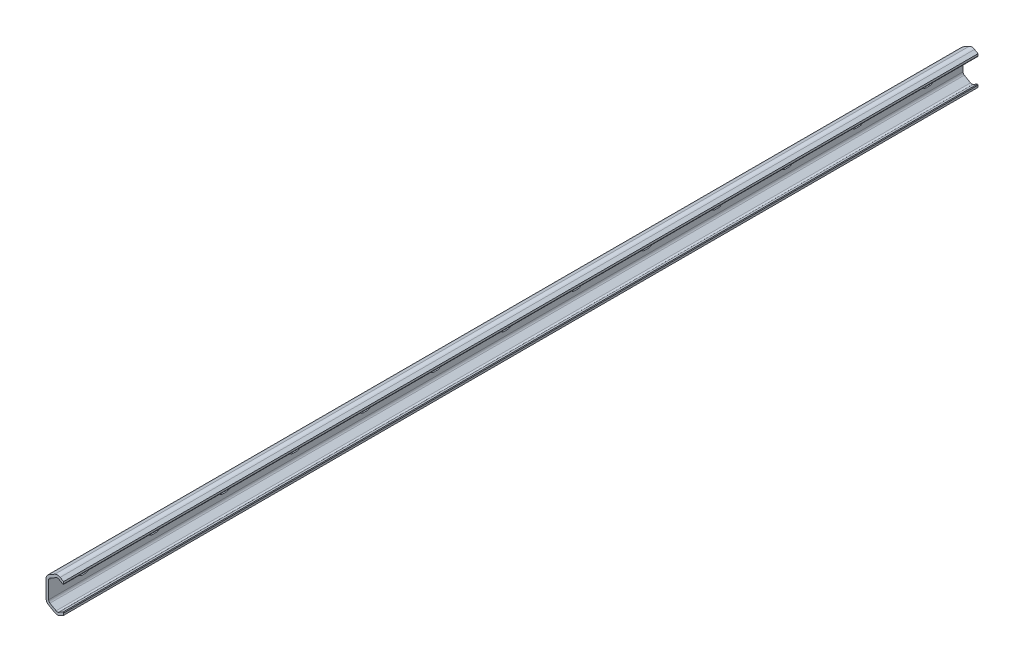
ISO-10303-21;
HEADER;
FILE_DESCRIPTION(('STEP AP214'),'2;1');
FILE_NAME('part.step','',(''),(''),'','','');
FILE_SCHEMA(('AUTOMOTIVE_DESIGN { 1 0 10303 214 1 1 1 1 }'));
ENDSEC;
DATA;
#1=APPLICATION_CONTEXT('core data for automotive mechanical design processes');
#2=APPLICATION_PROTOCOL_DEFINITION('international standard','automotive_design',2000,#1);
#3=PRODUCT_CONTEXT('',#1,'mechanical');
#4=PRODUCT('Part','Part','',(#3));
#5=PRODUCT_RELATED_PRODUCT_CATEGORY('part','',(#4));
#6=PRODUCT_DEFINITION_FORMATION('','',#4);
#7=PRODUCT_DEFINITION_CONTEXT('part definition',#1,'design');
#8=PRODUCT_DEFINITION('design','',#6,#7);
#9=PRODUCT_DEFINITION_SHAPE('','',#8);
#10=(LENGTH_UNIT() NAMED_UNIT(*) SI_UNIT(.MILLI.,.METRE.));
#11=(NAMED_UNIT(*) PLANE_ANGLE_UNIT() SI_UNIT($,.RADIAN.));
#12=(NAMED_UNIT(*) SI_UNIT($,.STERADIAN.) SOLID_ANGLE_UNIT());
#13=UNCERTAINTY_MEASURE_WITH_UNIT(LENGTH_MEASURE(1.E-05),#10,'distance_accuracy_value','');
#14=(GEOMETRIC_REPRESENTATION_CONTEXT(3) GLOBAL_UNCERTAINTY_ASSIGNED_CONTEXT((#13)) GLOBAL_UNIT_ASSIGNED_CONTEXT((#10,
#11,#12)) REPRESENTATION_CONTEXT('',''));
#15=CARTESIAN_POINT('',(0.,0.,0.));
#16=DIRECTION('',(0.,0.,1.));
#17=DIRECTION('',(1.,0.,0.));
#18=AXIS2_PLACEMENT_3D('',#15,#16,#17);
#19=CARTESIAN_POINT('',(0.,4.5,-1002.));
#20=DIRECTION('',(0.,1.,0.));
#21=DIRECTION('',(-1.,0.,0.));
#22=AXIS2_PLACEMENT_3D('',#19,#20,#21);
#23=PLANE('',#22);
#24=DIRECTION('',(0.,0.,1.));
#25=VECTOR('',#24,1.);
#26=CARTESIAN_POINT('',(2.9999817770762,4.5,-1002.));
#27=LINE('',#26,#25);
#28=CARTESIAN_POINT('',(2.9999817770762,4.5,-1002.));
#29=VERTEX_POINT('',#28);
#30=CARTESIAN_POINT('',(2.9999817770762,4.5,-998.));
#31=VERTEX_POINT('',#30);
#32=EDGE_CURVE('E1291',#29,#31,#27,.T.);
#33=ORIENTED_EDGE('',*,*,#32,.T.);
#34=DIRECTION('',(1.,0.,0.));
#35=VECTOR('',#34,1.);
#36=CARTESIAN_POINT('',(0.,4.5,-998.));
#37=LINE('',#36,#35);
#38=CARTESIAN_POINT('',(0.,4.5,-998.));
#39=VERTEX_POINT('',#38);
#40=EDGE_CURVE('E11',#39,#31,#37,.T.);
#41=ORIENTED_EDGE('',*,*,#40,.F.);
#42=DIRECTION('',(0.,0.,1.));
#43=VECTOR('',#42,1.);
#44=CARTESIAN_POINT('',(0.,4.5,-1002.));
#45=LINE('',#44,#43);
#46=CARTESIAN_POINT('',(0.,4.5,-1002.));
#47=VERTEX_POINT('',#46);
#48=EDGE_CURVE('E1297',#47,#39,#45,.T.);
#49=ORIENTED_EDGE('',*,*,#48,.F.);
#50=DIRECTION('',(1.,0.,0.));
#51=VECTOR('',#50,1.);
#52=CARTESIAN_POINT('',(0.,4.5,-1002.));
#53=LINE('',#52,#51);
#54=EDGE_CURVE('E1305',#47,#29,#53,.T.);
#55=ORIENTED_EDGE('',*,*,#54,.T.);
#56=EDGE_LOOP('',(#33,#41,#49,#55));
#57=FACE_BOUND('',#56,.T.);
#58=ADVANCED_FACE('F39',(#57),#23,.F.);
#59=CARTESIAN_POINT('',(0.,0.,-998.));
#60=DIRECTION('',(1.,0.,0.));
#61=DIRECTION('',(0.,1.,0.));
#62=AXIS2_PLACEMENT_3D('',#59,#60,#61);
#63=CYLINDRICAL_SURFACE('',#62,4.5);
#64=CARTESIAN_POINT('',(2.9999817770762,0.,-998.));
#65=DIRECTION('',(1.,0.,0.));
#66=DIRECTION('',(0.,1.,0.));
#67=AXIS2_PLACEMENT_3D('',#64,#65,#66);
#68=CIRCLE('',#67,4.5);
#69=CARTESIAN_POINT('',(2.9999817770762,-4.5,-998.));
#70=VERTEX_POINT('',#69);
#71=EDGE_CURVE('E1287',#31,#70,#68,.T.);
#72=ORIENTED_EDGE('',*,*,#71,.T.);
#73=DIRECTION('',(1.,0.,0.));
#74=VECTOR('',#73,1.);
#75=CARTESIAN_POINT('',(0.,-4.5,-998.));
#76=LINE('',#75,#74);
#77=CARTESIAN_POINT('',(0.,-4.5,-998.));
#78=VERTEX_POINT('',#77);
#79=EDGE_CURVE('E47',#78,#70,#76,.T.);
#80=ORIENTED_EDGE('',*,*,#79,.F.);
#81=CARTESIAN_POINT('',(0.,0.,-998.));
#82=DIRECTION('',(1.,0.,0.));
#83=DIRECTION('',(0.,1.,0.));
#84=AXIS2_PLACEMENT_3D('',#81,#82,#83);
#85=CIRCLE('',#84,4.5);
#86=EDGE_CURVE('E61',#39,#78,#85,.T.);
#87=ORIENTED_EDGE('',*,*,#86,.F.);
#88=ORIENTED_EDGE('',*,*,#40,.T.);
#89=EDGE_LOOP('',(#72,#80,#87,#88));
#90=FACE_BOUND('',#89,.T.);
#91=ADVANCED_FACE('F1318',(#90),#63,.F.);
#92=CARTESIAN_POINT('',(0.,-4.5,-1002.));
#93=DIRECTION('',(0.,-1.,0.));
#94=DIRECTION('',(1.,0.,0.));
#95=AXIS2_PLACEMENT_3D('',#92,#93,#94);
#96=PLANE('',#95);
#97=DIRECTION('',(0.,0.,-1.));
#98=VECTOR('',#97,1.);
#99=CARTESIAN_POINT('',(2.9999817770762,-4.5,-1002.));
#100=LINE('',#99,#98);
#101=CARTESIAN_POINT('',(2.9999817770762,-4.5,-1002.));
#102=VERTEX_POINT('',#101);
#103=EDGE_CURVE('E1283',#70,#102,#100,.T.);
#104=ORIENTED_EDGE('',*,*,#103,.T.);
#105=DIRECTION('',(1.,0.,0.));
#106=VECTOR('',#105,1.);
#107=CARTESIAN_POINT('',(0.,-4.5,-1002.));
#108=LINE('',#107,#106);
#109=CARTESIAN_POINT('',(0.,-4.5,-1002.));
#110=VERTEX_POINT('',#109);
#111=EDGE_CURVE('E1309',#110,#102,#108,.T.);
#112=ORIENTED_EDGE('',*,*,#111,.F.);
#113=DIRECTION('',(0.,0.,-1.));
#114=VECTOR('',#113,1.);
#115=CARTESIAN_POINT('',(0.,-4.5,-1002.));
#116=LINE('',#115,#114);
#117=EDGE_CURVE('E1302',#78,#110,#116,.T.);
#118=ORIENTED_EDGE('',*,*,#117,.F.);
#119=ORIENTED_EDGE('',*,*,#79,.T.);
#120=EDGE_LOOP('',(#104,#112,#118,#119));
#121=FACE_BOUND('',#120,.T.);
#122=ADVANCED_FACE('F1315',(#121),#96,.F.);
#123=CARTESIAN_POINT('',(0.,0.,-1002.));
#124=DIRECTION('',(1.,0.,0.));
#125=DIRECTION('',(0.,1.,0.));
#126=AXIS2_PLACEMENT_3D('',#123,#124,#125);
#127=CYLINDRICAL_SURFACE('',#126,4.5);
#128=CARTESIAN_POINT('',(2.9999817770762,0.,-1002.));
#129=DIRECTION('',(1.,0.,0.));
#130=DIRECTION('',(0.,1.,0.));
#131=AXIS2_PLACEMENT_3D('',#128,#129,#130);
#132=CIRCLE('',#131,4.5);
#133=EDGE_CURVE('E1280',#102,#29,#132,.T.);
#134=ORIENTED_EDGE('',*,*,#133,.T.);
#135=ORIENTED_EDGE('',*,*,#54,.F.);
#136=CARTESIAN_POINT('',(0.,0.,-1002.));
#137=DIRECTION('',(1.,0.,0.));
#138=DIRECTION('',(0.,1.,0.));
#139=AXIS2_PLACEMENT_3D('',#136,#137,#138);
#140=CIRCLE('',#139,4.5);
#141=EDGE_CURVE('E54',#110,#47,#140,.T.);
#142=ORIENTED_EDGE('',*,*,#141,.F.);
#143=ORIENTED_EDGE('',*,*,#111,.T.);
#144=EDGE_LOOP('',(#134,#135,#142,#143));
#145=FACE_BOUND('',#144,.T.);
#146=ADVANCED_FACE('F1324',(#145),#127,.F.);
#147=CARTESIAN_POINT('',(0.,4.5,-922.));
#148=DIRECTION('',(0.,1.,0.));
#149=DIRECTION('',(-1.,0.,0.));
#150=AXIS2_PLACEMENT_3D('',#147,#148,#149);
#151=PLANE('',#150);
#152=DIRECTION('',(0.,0.,1.));
#153=VECTOR('',#152,1.);
#154=CARTESIAN_POINT('',(2.9999817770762,4.5,-922.));
#155=LINE('',#154,#153);
#156=CARTESIAN_POINT('',(2.9999817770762,4.5,-922.));
#157=VERTEX_POINT('',#156);
#158=CARTESIAN_POINT('',(2.9999817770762,4.5,-918.));
#159=VERTEX_POINT('',#158);
#160=EDGE_CURVE('E1247',#157,#159,#155,.T.);
#161=ORIENTED_EDGE('',*,*,#160,.T.);
#162=DIRECTION('',(1.,0.,0.));
#163=VECTOR('',#162,1.);
#164=CARTESIAN_POINT('',(0.,4.5,-918.));
#165=LINE('',#164,#163);
#166=CARTESIAN_POINT('',(0.,4.5,-918.));
#167=VERTEX_POINT('',#166);
#168=EDGE_CURVE('E1276',#167,#159,#165,.T.);
#169=ORIENTED_EDGE('',*,*,#168,.F.);
#170=DIRECTION('',(0.,0.,1.));
#171=VECTOR('',#170,1.);
#172=CARTESIAN_POINT('',(0.,4.5,-922.));
#173=LINE('',#172,#171);
#174=CARTESIAN_POINT('',(0.,4.5,-922.));
#175=VERTEX_POINT('',#174);
#176=EDGE_CURVE('E1254',#175,#167,#173,.T.);
#177=ORIENTED_EDGE('',*,*,#176,.F.);
#178=DIRECTION('',(1.,0.,0.));
#179=VECTOR('',#178,1.);
#180=CARTESIAN_POINT('',(0.,4.5,-922.));
#181=LINE('',#180,#179);
#182=EDGE_CURVE('E1264',#175,#157,#181,.T.);
#183=ORIENTED_EDGE('',*,*,#182,.T.);
#184=EDGE_LOOP('',(#161,#169,#177,#183));
#185=FACE_BOUND('',#184,.T.);
#186=ADVANCED_FACE('F1326',(#185),#151,.F.);
#187=CARTESIAN_POINT('',(0.,0.,-918.));
#188=DIRECTION('',(1.,0.,0.));
#189=DIRECTION('',(0.,1.,0.));
#190=AXIS2_PLACEMENT_3D('',#187,#188,#189);
#191=CYLINDRICAL_SURFACE('',#190,4.5);
#192=CARTESIAN_POINT('',(2.9999817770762,0.,-918.));
#193=DIRECTION('',(1.,0.,0.));
#194=DIRECTION('',(0.,1.,0.));
#195=AXIS2_PLACEMENT_3D('',#192,#193,#194);
#196=CIRCLE('',#195,4.5);
#197=CARTESIAN_POINT('',(2.9999817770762,-4.5,-918.));
#198=VERTEX_POINT('',#197);
#199=EDGE_CURVE('E1243',#159,#198,#196,.T.);
#200=ORIENTED_EDGE('',*,*,#199,.T.);
#201=DIRECTION('',(1.,0.,0.));
#202=VECTOR('',#201,1.);
#203=CARTESIAN_POINT('',(0.,-4.5,-918.));
#204=LINE('',#203,#202);
#205=CARTESIAN_POINT('',(0.,-4.5,-918.));
#206=VERTEX_POINT('',#205);
#207=EDGE_CURVE('E1272',#206,#198,#204,.T.);
#208=ORIENTED_EDGE('',*,*,#207,.F.);
#209=CARTESIAN_POINT('',(0.,0.,-918.));
#210=DIRECTION('',(1.,0.,0.));
#211=DIRECTION('',(0.,1.,0.));
#212=AXIS2_PLACEMENT_3D('',#209,#210,#211);
#213=CIRCLE('',#212,4.5);
#214=EDGE_CURVE('E1257',#167,#206,#213,.T.);
#215=ORIENTED_EDGE('',*,*,#214,.F.);
#216=ORIENTED_EDGE('',*,*,#168,.T.);
#217=EDGE_LOOP('',(#200,#208,#215,#216));
#218=FACE_BOUND('',#217,.T.);
#219=ADVANCED_FACE('F1332',(#218),#191,.F.);
#220=CARTESIAN_POINT('',(0.,-4.5,-922.));
#221=DIRECTION('',(0.,-1.,0.));
#222=DIRECTION('',(1.,0.,0.));
#223=AXIS2_PLACEMENT_3D('',#220,#221,#222);
#224=PLANE('',#223);
#225=DIRECTION('',(0.,0.,-1.));
#226=VECTOR('',#225,1.);
#227=CARTESIAN_POINT('',(2.9999817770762,-4.5,-922.));
#228=LINE('',#227,#226);
#229=CARTESIAN_POINT('',(2.9999817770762,-4.5,-922.));
#230=VERTEX_POINT('',#229);
#231=EDGE_CURVE('E1239',#198,#230,#228,.T.);
#232=ORIENTED_EDGE('',*,*,#231,.T.);
#233=DIRECTION('',(1.,0.,0.));
#234=VECTOR('',#233,1.);
#235=CARTESIAN_POINT('',(0.,-4.5,-922.));
#236=LINE('',#235,#234);
#237=CARTESIAN_POINT('',(0.,-4.5,-922.));
#238=VERTEX_POINT('',#237);
#239=EDGE_CURVE('E1268',#238,#230,#236,.T.);
#240=ORIENTED_EDGE('',*,*,#239,.F.);
#241=DIRECTION('',(0.,0.,-1.));
#242=VECTOR('',#241,1.);
#243=CARTESIAN_POINT('',(0.,-4.5,-922.));
#244=LINE('',#243,#242);
#245=EDGE_CURVE('E1260',#206,#238,#244,.T.);
#246=ORIENTED_EDGE('',*,*,#245,.F.);
#247=ORIENTED_EDGE('',*,*,#207,.T.);
#248=EDGE_LOOP('',(#232,#240,#246,#247));
#249=FACE_BOUND('',#248,.T.);
#250=ADVANCED_FACE('F1360',(#249),#224,.F.);
#251=CARTESIAN_POINT('',(0.,0.,-922.));
#252=DIRECTION('',(1.,0.,0.));
#253=DIRECTION('',(0.,1.,0.));
#254=AXIS2_PLACEMENT_3D('',#251,#252,#253);
#255=CYLINDRICAL_SURFACE('',#254,4.5);
#256=CARTESIAN_POINT('',(2.9999817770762,0.,-922.));
#257=DIRECTION('',(1.,0.,0.));
#258=DIRECTION('',(0.,1.,0.));
#259=AXIS2_PLACEMENT_3D('',#256,#257,#258);
#260=CIRCLE('',#259,4.5);
#261=EDGE_CURVE('E1236',#230,#157,#260,.T.);
#262=ORIENTED_EDGE('',*,*,#261,.T.);
#263=ORIENTED_EDGE('',*,*,#182,.F.);
#264=CARTESIAN_POINT('',(0.,0.,-922.));
#265=DIRECTION('',(1.,0.,0.));
#266=DIRECTION('',(0.,1.,0.));
#267=AXIS2_PLACEMENT_3D('',#264,#265,#266);
#268=CIRCLE('',#267,4.5);
#269=EDGE_CURVE('E1251',#238,#175,#268,.T.);
#270=ORIENTED_EDGE('',*,*,#269,.F.);
#271=ORIENTED_EDGE('',*,*,#239,.T.);
#272=EDGE_LOOP('',(#262,#263,#270,#271));
#273=FACE_BOUND('',#272,.T.);
#274=ADVANCED_FACE('F1369',(#273),#255,.F.);
#275=CARTESIAN_POINT('',(0.,4.5,-842.));
#276=DIRECTION('',(0.,1.,0.));
#277=DIRECTION('',(-1.,0.,0.));
#278=AXIS2_PLACEMENT_3D('',#275,#276,#277);
#279=PLANE('',#278);
#280=DIRECTION('',(0.,0.,1.));
#281=VECTOR('',#280,1.);
#282=CARTESIAN_POINT('',(2.9999817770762,4.5,-842.));
#283=LINE('',#282,#281);
#284=CARTESIAN_POINT('',(2.9999817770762,4.5,-842.));
#285=VERTEX_POINT('',#284);
#286=CARTESIAN_POINT('',(2.9999817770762,4.5,-838.));
#287=VERTEX_POINT('',#286);
#288=EDGE_CURVE('E1203',#285,#287,#283,.T.);
#289=ORIENTED_EDGE('',*,*,#288,.T.);
#290=DIRECTION('',(1.,0.,0.));
#291=VECTOR('',#290,1.);
#292=CARTESIAN_POINT('',(0.,4.5,-838.));
#293=LINE('',#292,#291);
#294=CARTESIAN_POINT('',(0.,4.5,-838.));
#295=VERTEX_POINT('',#294);
#296=EDGE_CURVE('E1232',#295,#287,#293,.T.);
#297=ORIENTED_EDGE('',*,*,#296,.F.);
#298=DIRECTION('',(0.,0.,1.));
#299=VECTOR('',#298,1.);
#300=CARTESIAN_POINT('',(0.,4.5,-842.));
#301=LINE('',#300,#299);
#302=CARTESIAN_POINT('',(0.,4.5,-842.));
#303=VERTEX_POINT('',#302);
#304=EDGE_CURVE('E1210',#303,#295,#301,.T.);
#305=ORIENTED_EDGE('',*,*,#304,.F.);
#306=DIRECTION('',(1.,0.,0.));
#307=VECTOR('',#306,1.);
#308=CARTESIAN_POINT('',(0.,4.5,-842.));
#309=LINE('',#308,#307);
#310=EDGE_CURVE('E1220',#303,#285,#309,.T.);
#311=ORIENTED_EDGE('',*,*,#310,.T.);
#312=EDGE_LOOP('',(#289,#297,#305,#311));
#313=FACE_BOUND('',#312,.T.);
#314=ADVANCED_FACE('F1378',(#313),#279,.F.);
#315=CARTESIAN_POINT('',(0.,0.,-838.));
#316=DIRECTION('',(1.,0.,0.));
#317=DIRECTION('',(0.,1.,0.));
#318=AXIS2_PLACEMENT_3D('',#315,#316,#317);
#319=CYLINDRICAL_SURFACE('',#318,4.5);
#320=CARTESIAN_POINT('',(2.9999817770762,0.,-838.));
#321=DIRECTION('',(1.,0.,0.));
#322=DIRECTION('',(0.,1.,0.));
#323=AXIS2_PLACEMENT_3D('',#320,#321,#322);
#324=CIRCLE('',#323,4.5);
#325=CARTESIAN_POINT('',(2.9999817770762,-4.5,-838.));
#326=VERTEX_POINT('',#325);
#327=EDGE_CURVE('E1199',#287,#326,#324,.T.);
#328=ORIENTED_EDGE('',*,*,#327,.T.);
#329=DIRECTION('',(1.,0.,0.));
#330=VECTOR('',#329,1.);
#331=CARTESIAN_POINT('',(0.,-4.5,-838.));
#332=LINE('',#331,#330);
#333=CARTESIAN_POINT('',(0.,-4.5,-838.));
#334=VERTEX_POINT('',#333);
#335=EDGE_CURVE('E1228',#334,#326,#332,.T.);
#336=ORIENTED_EDGE('',*,*,#335,.F.);
#337=CARTESIAN_POINT('',(0.,0.,-838.));
#338=DIRECTION('',(1.,0.,0.));
#339=DIRECTION('',(0.,1.,0.));
#340=AXIS2_PLACEMENT_3D('',#337,#338,#339);
#341=CIRCLE('',#340,4.5);
#342=EDGE_CURVE('E1213',#295,#334,#341,.T.);
#343=ORIENTED_EDGE('',*,*,#342,.F.);
#344=ORIENTED_EDGE('',*,*,#296,.T.);
#345=EDGE_LOOP('',(#328,#336,#343,#344));
#346=FACE_BOUND('',#345,.T.);
#347=ADVANCED_FACE('F1387',(#346),#319,.F.);
#348=CARTESIAN_POINT('',(0.,-4.5,-842.));
#349=DIRECTION('',(0.,-1.,0.));
#350=DIRECTION('',(1.,0.,0.));
#351=AXIS2_PLACEMENT_3D('',#348,#349,#350);
#352=PLANE('',#351);
#353=DIRECTION('',(0.,0.,-1.));
#354=VECTOR('',#353,1.);
#355=CARTESIAN_POINT('',(2.9999817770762,-4.5,-842.));
#356=LINE('',#355,#354);
#357=CARTESIAN_POINT('',(2.9999817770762,-4.5,-842.));
#358=VERTEX_POINT('',#357);
#359=EDGE_CURVE('E1195',#326,#358,#356,.T.);
#360=ORIENTED_EDGE('',*,*,#359,.T.);
#361=DIRECTION('',(1.,0.,0.));
#362=VECTOR('',#361,1.);
#363=CARTESIAN_POINT('',(0.,-4.5,-842.));
#364=LINE('',#363,#362);
#365=CARTESIAN_POINT('',(0.,-4.5,-842.));
#366=VERTEX_POINT('',#365);
#367=EDGE_CURVE('E1224',#366,#358,#364,.T.);
#368=ORIENTED_EDGE('',*,*,#367,.F.);
#369=DIRECTION('',(0.,0.,-1.));
#370=VECTOR('',#369,1.);
#371=CARTESIAN_POINT('',(0.,-4.5,-842.));
#372=LINE('',#371,#370);
#373=EDGE_CURVE('E1216',#334,#366,#372,.T.);
#374=ORIENTED_EDGE('',*,*,#373,.F.);
#375=ORIENTED_EDGE('',*,*,#335,.T.);
#376=EDGE_LOOP('',(#360,#368,#374,#375));
#377=FACE_BOUND('',#376,.T.);
#378=ADVANCED_FACE('F1396',(#377),#352,.F.);
#379=CARTESIAN_POINT('',(0.,0.,-842.));
#380=DIRECTION('',(1.,0.,0.));
#381=DIRECTION('',(0.,1.,0.));
#382=AXIS2_PLACEMENT_3D('',#379,#380,#381);
#383=CYLINDRICAL_SURFACE('',#382,4.5);
#384=CARTESIAN_POINT('',(2.9999817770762,0.,-842.));
#385=DIRECTION('',(1.,0.,0.));
#386=DIRECTION('',(0.,1.,0.));
#387=AXIS2_PLACEMENT_3D('',#384,#385,#386);
#388=CIRCLE('',#387,4.5);
#389=EDGE_CURVE('E1192',#358,#285,#388,.T.);
#390=ORIENTED_EDGE('',*,*,#389,.T.);
#391=ORIENTED_EDGE('',*,*,#310,.F.);
#392=CARTESIAN_POINT('',(0.,0.,-842.));
#393=DIRECTION('',(1.,0.,0.));
#394=DIRECTION('',(0.,1.,0.));
#395=AXIS2_PLACEMENT_3D('',#392,#393,#394);
#396=CIRCLE('',#395,4.5);
#397=EDGE_CURVE('E1207',#366,#303,#396,.T.);
#398=ORIENTED_EDGE('',*,*,#397,.F.);
#399=ORIENTED_EDGE('',*,*,#367,.T.);
#400=EDGE_LOOP('',(#390,#391,#398,#399));
#401=FACE_BOUND('',#400,.T.);
#402=ADVANCED_FACE('F1405',(#401),#383,.F.);
#403=CARTESIAN_POINT('',(0.,4.5,-762.));
#404=DIRECTION('',(0.,1.,0.));
#405=DIRECTION('',(-1.,0.,0.));
#406=AXIS2_PLACEMENT_3D('',#403,#404,#405);
#407=PLANE('',#406);
#408=DIRECTION('',(0.,0.,1.));
#409=VECTOR('',#408,1.);
#410=CARTESIAN_POINT('',(2.9999817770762,4.5,-762.));
#411=LINE('',#410,#409);
#412=CARTESIAN_POINT('',(2.9999817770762,4.5,-762.));
#413=VERTEX_POINT('',#412);
#414=CARTESIAN_POINT('',(2.9999817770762,4.5,-758.));
#415=VERTEX_POINT('',#414);
#416=EDGE_CURVE('E1159',#413,#415,#411,.T.);
#417=ORIENTED_EDGE('',*,*,#416,.T.);
#418=DIRECTION('',(1.,0.,0.));
#419=VECTOR('',#418,1.);
#420=CARTESIAN_POINT('',(0.,4.5,-758.));
#421=LINE('',#420,#419);
#422=CARTESIAN_POINT('',(0.,4.5,-758.));
#423=VERTEX_POINT('',#422);
#424=EDGE_CURVE('E1188',#423,#415,#421,.T.);
#425=ORIENTED_EDGE('',*,*,#424,.F.);
#426=DIRECTION('',(0.,0.,1.));
#427=VECTOR('',#426,1.);
#428=CARTESIAN_POINT('',(0.,4.5,-762.));
#429=LINE('',#428,#427);
#430=CARTESIAN_POINT('',(0.,4.5,-762.));
#431=VERTEX_POINT('',#430);
#432=EDGE_CURVE('E1166',#431,#423,#429,.T.);
#433=ORIENTED_EDGE('',*,*,#432,.F.);
#434=DIRECTION('',(1.,0.,0.));
#435=VECTOR('',#434,1.);
#436=CARTESIAN_POINT('',(0.,4.5,-762.));
#437=LINE('',#436,#435);
#438=EDGE_CURVE('E1176',#431,#413,#437,.T.);
#439=ORIENTED_EDGE('',*,*,#438,.T.);
#440=EDGE_LOOP('',(#417,#425,#433,#439));
#441=FACE_BOUND('',#440,.T.);
#442=ADVANCED_FACE('F1414',(#441),#407,.F.);
#443=CARTESIAN_POINT('',(0.,0.,-758.));
#444=DIRECTION('',(1.,0.,0.));
#445=DIRECTION('',(0.,1.,0.));
#446=AXIS2_PLACEMENT_3D('',#443,#444,#445);
#447=CYLINDRICAL_SURFACE('',#446,4.5);
#448=CARTESIAN_POINT('',(2.9999817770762,0.,-758.));
#449=DIRECTION('',(1.,0.,0.));
#450=DIRECTION('',(0.,1.,0.));
#451=AXIS2_PLACEMENT_3D('',#448,#449,#450);
#452=CIRCLE('',#451,4.5);
#453=CARTESIAN_POINT('',(2.9999817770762,-4.5,-758.));
#454=VERTEX_POINT('',#453);
#455=EDGE_CURVE('E1155',#415,#454,#452,.T.);
#456=ORIENTED_EDGE('',*,*,#455,.T.);
#457=DIRECTION('',(1.,0.,0.));
#458=VECTOR('',#457,1.);
#459=CARTESIAN_POINT('',(0.,-4.5,-758.));
#460=LINE('',#459,#458);
#461=CARTESIAN_POINT('',(0.,-4.5,-758.));
#462=VERTEX_POINT('',#461);
#463=EDGE_CURVE('E1184',#462,#454,#460,.T.);
#464=ORIENTED_EDGE('',*,*,#463,.F.);
#465=CARTESIAN_POINT('',(0.,0.,-758.));
#466=DIRECTION('',(1.,0.,0.));
#467=DIRECTION('',(0.,1.,0.));
#468=AXIS2_PLACEMENT_3D('',#465,#466,#467);
#469=CIRCLE('',#468,4.5);
#470=EDGE_CURVE('E1169',#423,#462,#469,.T.);
#471=ORIENTED_EDGE('',*,*,#470,.F.);
#472=ORIENTED_EDGE('',*,*,#424,.T.);
#473=EDGE_LOOP('',(#456,#464,#471,#472));
#474=FACE_BOUND('',#473,.T.);
#475=ADVANCED_FACE('F1423',(#474),#447,.F.);
#476=CARTESIAN_POINT('',(0.,-4.5,-762.));
#477=DIRECTION('',(0.,-1.,0.));
#478=DIRECTION('',(1.,0.,0.));
#479=AXIS2_PLACEMENT_3D('',#476,#477,#478);
#480=PLANE('',#479);
#481=DIRECTION('',(0.,0.,-1.));
#482=VECTOR('',#481,1.);
#483=CARTESIAN_POINT('',(2.9999817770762,-4.5,-762.));
#484=LINE('',#483,#482);
#485=CARTESIAN_POINT('',(2.9999817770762,-4.5,-762.));
#486=VERTEX_POINT('',#485);
#487=EDGE_CURVE('E1151',#454,#486,#484,.T.);
#488=ORIENTED_EDGE('',*,*,#487,.T.);
#489=DIRECTION('',(1.,0.,0.));
#490=VECTOR('',#489,1.);
#491=CARTESIAN_POINT('',(0.,-4.5,-762.));
#492=LINE('',#491,#490);
#493=CARTESIAN_POINT('',(0.,-4.5,-762.));
#494=VERTEX_POINT('',#493);
#495=EDGE_CURVE('E1180',#494,#486,#492,.T.);
#496=ORIENTED_EDGE('',*,*,#495,.F.);
#497=DIRECTION('',(0.,0.,-1.));
#498=VECTOR('',#497,1.);
#499=CARTESIAN_POINT('',(0.,-4.5,-762.));
#500=LINE('',#499,#498);
#501=EDGE_CURVE('E1172',#462,#494,#500,.T.);
#502=ORIENTED_EDGE('',*,*,#501,.F.);
#503=ORIENTED_EDGE('',*,*,#463,.T.);
#504=EDGE_LOOP('',(#488,#496,#502,#503));
#505=FACE_BOUND('',#504,.T.);
#506=ADVANCED_FACE('F1432',(#505),#480,.F.);
#507=CARTESIAN_POINT('',(0.,0.,-762.));
#508=DIRECTION('',(1.,0.,0.));
#509=DIRECTION('',(0.,1.,0.));
#510=AXIS2_PLACEMENT_3D('',#507,#508,#509);
#511=CYLINDRICAL_SURFACE('',#510,4.5);
#512=CARTESIAN_POINT('',(2.9999817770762,0.,-762.));
#513=DIRECTION('',(1.,0.,0.));
#514=DIRECTION('',(0.,1.,0.));
#515=AXIS2_PLACEMENT_3D('',#512,#513,#514);
#516=CIRCLE('',#515,4.5);
#517=EDGE_CURVE('E1148',#486,#413,#516,.T.);
#518=ORIENTED_EDGE('',*,*,#517,.T.);
#519=ORIENTED_EDGE('',*,*,#438,.F.);
#520=CARTESIAN_POINT('',(0.,0.,-762.));
#521=DIRECTION('',(1.,0.,0.));
#522=DIRECTION('',(0.,1.,0.));
#523=AXIS2_PLACEMENT_3D('',#520,#521,#522);
#524=CIRCLE('',#523,4.5);
#525=EDGE_CURVE('E1163',#494,#431,#524,.T.);
#526=ORIENTED_EDGE('',*,*,#525,.F.);
#527=ORIENTED_EDGE('',*,*,#495,.T.);
#528=EDGE_LOOP('',(#518,#519,#526,#527));
#529=FACE_BOUND('',#528,.T.);
#530=ADVANCED_FACE('F1441',(#529),#511,.F.);
#531=CARTESIAN_POINT('',(0.,4.5,-682.));
#532=DIRECTION('',(0.,1.,0.));
#533=DIRECTION('',(-1.,0.,0.));
#534=AXIS2_PLACEMENT_3D('',#531,#532,#533);
#535=PLANE('',#534);
#536=DIRECTION('',(0.,0.,1.));
#537=VECTOR('',#536,1.);
#538=CARTESIAN_POINT('',(2.9999817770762,4.5,-682.));
#539=LINE('',#538,#537);
#540=CARTESIAN_POINT('',(2.9999817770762,4.5,-682.));
#541=VERTEX_POINT('',#540);
#542=CARTESIAN_POINT('',(2.9999817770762,4.5,-678.));
#543=VERTEX_POINT('',#542);
#544=EDGE_CURVE('E1115',#541,#543,#539,.T.);
#545=ORIENTED_EDGE('',*,*,#544,.T.);
#546=DIRECTION('',(1.,0.,0.));
#547=VECTOR('',#546,1.);
#548=CARTESIAN_POINT('',(0.,4.5,-678.));
#549=LINE('',#548,#547);
#550=CARTESIAN_POINT('',(0.,4.5,-678.));
#551=VERTEX_POINT('',#550);
#552=EDGE_CURVE('E1144',#551,#543,#549,.T.);
#553=ORIENTED_EDGE('',*,*,#552,.F.);
#554=DIRECTION('',(0.,0.,1.));
#555=VECTOR('',#554,1.);
#556=CARTESIAN_POINT('',(0.,4.5,-682.));
#557=LINE('',#556,#555);
#558=CARTESIAN_POINT('',(0.,4.5,-682.));
#559=VERTEX_POINT('',#558);
#560=EDGE_CURVE('E1122',#559,#551,#557,.T.);
#561=ORIENTED_EDGE('',*,*,#560,.F.);
#562=DIRECTION('',(1.,0.,0.));
#563=VECTOR('',#562,1.);
#564=CARTESIAN_POINT('',(0.,4.5,-682.));
#565=LINE('',#564,#563);
#566=EDGE_CURVE('E1132',#559,#541,#565,.T.);
#567=ORIENTED_EDGE('',*,*,#566,.T.);
#568=EDGE_LOOP('',(#545,#553,#561,#567));
#569=FACE_BOUND('',#568,.T.);
#570=ADVANCED_FACE('F1450',(#569),#535,.F.);
#571=CARTESIAN_POINT('',(0.,0.,-678.));
#572=DIRECTION('',(1.,0.,0.));
#573=DIRECTION('',(0.,1.,0.));
#574=AXIS2_PLACEMENT_3D('',#571,#572,#573);
#575=CYLINDRICAL_SURFACE('',#574,4.5);
#576=CARTESIAN_POINT('',(2.9999817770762,0.,-678.));
#577=DIRECTION('',(1.,0.,0.));
#578=DIRECTION('',(0.,1.,0.));
#579=AXIS2_PLACEMENT_3D('',#576,#577,#578);
#580=CIRCLE('',#579,4.5);
#581=CARTESIAN_POINT('',(2.9999817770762,-4.5,-678.));
#582=VERTEX_POINT('',#581);
#583=EDGE_CURVE('E1111',#543,#582,#580,.T.);
#584=ORIENTED_EDGE('',*,*,#583,.T.);
#585=DIRECTION('',(1.,0.,0.));
#586=VECTOR('',#585,1.);
#587=CARTESIAN_POINT('',(0.,-4.5,-678.));
#588=LINE('',#587,#586);
#589=CARTESIAN_POINT('',(0.,-4.5,-678.));
#590=VERTEX_POINT('',#589);
#591=EDGE_CURVE('E1140',#590,#582,#588,.T.);
#592=ORIENTED_EDGE('',*,*,#591,.F.);
#593=CARTESIAN_POINT('',(0.,0.,-678.));
#594=DIRECTION('',(1.,0.,0.));
#595=DIRECTION('',(0.,1.,0.));
#596=AXIS2_PLACEMENT_3D('',#593,#594,#595);
#597=CIRCLE('',#596,4.5);
#598=EDGE_CURVE('E1125',#551,#590,#597,.T.);
#599=ORIENTED_EDGE('',*,*,#598,.F.);
#600=ORIENTED_EDGE('',*,*,#552,.T.);
#601=EDGE_LOOP('',(#584,#592,#599,#600));
#602=FACE_BOUND('',#601,.T.);
#603=ADVANCED_FACE('F1459',(#602),#575,.F.);
#604=CARTESIAN_POINT('',(0.,-4.5,-682.));
#605=DIRECTION('',(0.,-1.,0.));
#606=DIRECTION('',(1.,0.,0.));
#607=AXIS2_PLACEMENT_3D('',#604,#605,#606);
#608=PLANE('',#607);
#609=DIRECTION('',(0.,0.,-1.));
#610=VECTOR('',#609,1.);
#611=CARTESIAN_POINT('',(2.9999817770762,-4.5,-682.));
#612=LINE('',#611,#610);
#613=CARTESIAN_POINT('',(2.9999817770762,-4.5,-682.));
#614=VERTEX_POINT('',#613);
#615=EDGE_CURVE('E1107',#582,#614,#612,.T.);
#616=ORIENTED_EDGE('',*,*,#615,.T.);
#617=DIRECTION('',(1.,0.,0.));
#618=VECTOR('',#617,1.);
#619=CARTESIAN_POINT('',(0.,-4.5,-682.));
#620=LINE('',#619,#618);
#621=CARTESIAN_POINT('',(0.,-4.5,-682.));
#622=VERTEX_POINT('',#621);
#623=EDGE_CURVE('E1136',#622,#614,#620,.T.);
#624=ORIENTED_EDGE('',*,*,#623,.F.);
#625=DIRECTION('',(0.,0.,-1.));
#626=VECTOR('',#625,1.);
#627=CARTESIAN_POINT('',(0.,-4.5,-682.));
#628=LINE('',#627,#626);
#629=EDGE_CURVE('E1128',#590,#622,#628,.T.);
#630=ORIENTED_EDGE('',*,*,#629,.F.);
#631=ORIENTED_EDGE('',*,*,#591,.T.);
#632=EDGE_LOOP('',(#616,#624,#630,#631));
#633=FACE_BOUND('',#632,.T.);
#634=ADVANCED_FACE('F1468',(#633),#608,.F.);
#635=CARTESIAN_POINT('',(0.,0.,-682.));
#636=DIRECTION('',(1.,0.,0.));
#637=DIRECTION('',(0.,1.,0.));
#638=AXIS2_PLACEMENT_3D('',#635,#636,#637);
#639=CYLINDRICAL_SURFACE('',#638,4.5);
#640=CARTESIAN_POINT('',(2.9999817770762,0.,-682.));
#641=DIRECTION('',(1.,0.,0.));
#642=DIRECTION('',(0.,1.,0.));
#643=AXIS2_PLACEMENT_3D('',#640,#641,#642);
#644=CIRCLE('',#643,4.5);
#645=EDGE_CURVE('E1104',#614,#541,#644,.T.);
#646=ORIENTED_EDGE('',*,*,#645,.T.);
#647=ORIENTED_EDGE('',*,*,#566,.F.);
#648=CARTESIAN_POINT('',(0.,0.,-682.));
#649=DIRECTION('',(1.,0.,0.));
#650=DIRECTION('',(0.,1.,0.));
#651=AXIS2_PLACEMENT_3D('',#648,#649,#650);
#652=CIRCLE('',#651,4.5);
#653=EDGE_CURVE('E1119',#622,#559,#652,.T.);
#654=ORIENTED_EDGE('',*,*,#653,.F.);
#655=ORIENTED_EDGE('',*,*,#623,.T.);
#656=EDGE_LOOP('',(#646,#647,#654,#655));
#657=FACE_BOUND('',#656,.T.);
#658=ADVANCED_FACE('F1477',(#657),#639,.F.);
#659=CARTESIAN_POINT('',(0.,4.5,-602.));
#660=DIRECTION('',(0.,1.,0.));
#661=DIRECTION('',(-1.,0.,0.));
#662=AXIS2_PLACEMENT_3D('',#659,#660,#661);
#663=PLANE('',#662);
#664=DIRECTION('',(0.,0.,1.));
#665=VECTOR('',#664,1.);
#666=CARTESIAN_POINT('',(2.9999817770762,4.5,-602.));
#667=LINE('',#666,#665);
#668=CARTESIAN_POINT('',(2.9999817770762,4.5,-602.));
#669=VERTEX_POINT('',#668);
#670=CARTESIAN_POINT('',(2.9999817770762,4.5,-598.));
#671=VERTEX_POINT('',#670);
#672=EDGE_CURVE('E1071',#669,#671,#667,.T.);
#673=ORIENTED_EDGE('',*,*,#672,.T.);
#674=DIRECTION('',(1.,0.,0.));
#675=VECTOR('',#674,1.);
#676=CARTESIAN_POINT('',(0.,4.5,-598.));
#677=LINE('',#676,#675);
#678=CARTESIAN_POINT('',(0.,4.5,-598.));
#679=VERTEX_POINT('',#678);
#680=EDGE_CURVE('E1100',#679,#671,#677,.T.);
#681=ORIENTED_EDGE('',*,*,#680,.F.);
#682=DIRECTION('',(0.,0.,1.));
#683=VECTOR('',#682,1.);
#684=CARTESIAN_POINT('',(0.,4.5,-602.));
#685=LINE('',#684,#683);
#686=CARTESIAN_POINT('',(0.,4.5,-602.));
#687=VERTEX_POINT('',#686);
#688=EDGE_CURVE('E1078',#687,#679,#685,.T.);
#689=ORIENTED_EDGE('',*,*,#688,.F.);
#690=DIRECTION('',(1.,0.,0.));
#691=VECTOR('',#690,1.);
#692=CARTESIAN_POINT('',(0.,4.5,-602.));
#693=LINE('',#692,#691);
#694=EDGE_CURVE('E1088',#687,#669,#693,.T.);
#695=ORIENTED_EDGE('',*,*,#694,.T.);
#696=EDGE_LOOP('',(#673,#681,#689,#695));
#697=FACE_BOUND('',#696,.T.);
#698=ADVANCED_FACE('F1486',(#697),#663,.F.);
#699=CARTESIAN_POINT('',(0.,0.,-598.));
#700=DIRECTION('',(1.,0.,0.));
#701=DIRECTION('',(0.,1.,0.));
#702=AXIS2_PLACEMENT_3D('',#699,#700,#701);
#703=CYLINDRICAL_SURFACE('',#702,4.5);
#704=CARTESIAN_POINT('',(2.9999817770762,0.,-598.));
#705=DIRECTION('',(1.,0.,0.));
#706=DIRECTION('',(0.,1.,0.));
#707=AXIS2_PLACEMENT_3D('',#704,#705,#706);
#708=CIRCLE('',#707,4.5);
#709=CARTESIAN_POINT('',(2.9999817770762,-4.5,-598.));
#710=VERTEX_POINT('',#709);
#711=EDGE_CURVE('E1067',#671,#710,#708,.T.);
#712=ORIENTED_EDGE('',*,*,#711,.T.);
#713=DIRECTION('',(1.,0.,0.));
#714=VECTOR('',#713,1.);
#715=CARTESIAN_POINT('',(0.,-4.5,-598.));
#716=LINE('',#715,#714);
#717=CARTESIAN_POINT('',(0.,-4.5,-598.));
#718=VERTEX_POINT('',#717);
#719=EDGE_CURVE('E1096',#718,#710,#716,.T.);
#720=ORIENTED_EDGE('',*,*,#719,.F.);
#721=CARTESIAN_POINT('',(0.,0.,-598.));
#722=DIRECTION('',(1.,0.,0.));
#723=DIRECTION('',(0.,1.,0.));
#724=AXIS2_PLACEMENT_3D('',#721,#722,#723);
#725=CIRCLE('',#724,4.5);
#726=EDGE_CURVE('E1081',#679,#718,#725,.T.);
#727=ORIENTED_EDGE('',*,*,#726,.F.);
#728=ORIENTED_EDGE('',*,*,#680,.T.);
#729=EDGE_LOOP('',(#712,#720,#727,#728));
#730=FACE_BOUND('',#729,.T.);
#731=ADVANCED_FACE('F1495',(#730),#703,.F.);
#732=CARTESIAN_POINT('',(0.,-4.5,-602.));
#733=DIRECTION('',(0.,-1.,0.));
#734=DIRECTION('',(1.,0.,0.));
#735=AXIS2_PLACEMENT_3D('',#732,#733,#734);
#736=PLANE('',#735);
#737=DIRECTION('',(0.,0.,-1.));
#738=VECTOR('',#737,1.);
#739=CARTESIAN_POINT('',(2.9999817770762,-4.5,-602.));
#740=LINE('',#739,#738);
#741=CARTESIAN_POINT('',(2.9999817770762,-4.5,-602.));
#742=VERTEX_POINT('',#741);
#743=EDGE_CURVE('E1063',#710,#742,#740,.T.);
#744=ORIENTED_EDGE('',*,*,#743,.T.);
#745=DIRECTION('',(1.,0.,0.));
#746=VECTOR('',#745,1.);
#747=CARTESIAN_POINT('',(0.,-4.5,-602.));
#748=LINE('',#747,#746);
#749=CARTESIAN_POINT('',(0.,-4.5,-602.));
#750=VERTEX_POINT('',#749);
#751=EDGE_CURVE('E1092',#750,#742,#748,.T.);
#752=ORIENTED_EDGE('',*,*,#751,.F.);
#753=DIRECTION('',(0.,0.,-1.));
#754=VECTOR('',#753,1.);
#755=CARTESIAN_POINT('',(0.,-4.5,-602.));
#756=LINE('',#755,#754);
#757=EDGE_CURVE('E1084',#718,#750,#756,.T.);
#758=ORIENTED_EDGE('',*,*,#757,.F.);
#759=ORIENTED_EDGE('',*,*,#719,.T.);
#760=EDGE_LOOP('',(#744,#752,#758,#759));
#761=FACE_BOUND('',#760,.T.);
#762=ADVANCED_FACE('F1504',(#761),#736,.F.);
#763=CARTESIAN_POINT('',(0.,0.,-602.));
#764=DIRECTION('',(1.,0.,0.));
#765=DIRECTION('',(0.,1.,0.));
#766=AXIS2_PLACEMENT_3D('',#763,#764,#765);
#767=CYLINDRICAL_SURFACE('',#766,4.5);
#768=CARTESIAN_POINT('',(2.9999817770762,0.,-602.));
#769=DIRECTION('',(1.,0.,0.));
#770=DIRECTION('',(0.,1.,0.));
#771=AXIS2_PLACEMENT_3D('',#768,#769,#770);
#772=CIRCLE('',#771,4.5);
#773=EDGE_CURVE('E1060',#742,#669,#772,.T.);
#774=ORIENTED_EDGE('',*,*,#773,.T.);
#775=ORIENTED_EDGE('',*,*,#694,.F.);
#776=CARTESIAN_POINT('',(0.,0.,-602.));
#777=DIRECTION('',(1.,0.,0.));
#778=DIRECTION('',(0.,1.,0.));
#779=AXIS2_PLACEMENT_3D('',#776,#777,#778);
#780=CIRCLE('',#779,4.5);
#781=EDGE_CURVE('E1075',#750,#687,#780,.T.);
#782=ORIENTED_EDGE('',*,*,#781,.F.);
#783=ORIENTED_EDGE('',*,*,#751,.T.);
#784=EDGE_LOOP('',(#774,#775,#782,#783));
#785=FACE_BOUND('',#784,.T.);
#786=ADVANCED_FACE('F1513',(#785),#767,.F.);
#787=CARTESIAN_POINT('',(0.,4.5,-522.));
#788=DIRECTION('',(0.,1.,0.));
#789=DIRECTION('',(-1.,0.,0.));
#790=AXIS2_PLACEMENT_3D('',#787,#788,#789);
#791=PLANE('',#790);
#792=DIRECTION('',(0.,0.,1.));
#793=VECTOR('',#792,1.);
#794=CARTESIAN_POINT('',(2.9999817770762,4.5,-522.));
#795=LINE('',#794,#793);
#796=CARTESIAN_POINT('',(2.9999817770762,4.5,-522.));
#797=VERTEX_POINT('',#796);
#798=CARTESIAN_POINT('',(2.9999817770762,4.5,-518.));
#799=VERTEX_POINT('',#798);
#800=EDGE_CURVE('E1027',#797,#799,#795,.T.);
#801=ORIENTED_EDGE('',*,*,#800,.T.);
#802=DIRECTION('',(1.,0.,0.));
#803=VECTOR('',#802,1.);
#804=CARTESIAN_POINT('',(0.,4.5,-518.));
#805=LINE('',#804,#803);
#806=CARTESIAN_POINT('',(0.,4.5,-518.));
#807=VERTEX_POINT('',#806);
#808=EDGE_CURVE('E1056',#807,#799,#805,.T.);
#809=ORIENTED_EDGE('',*,*,#808,.F.);
#810=DIRECTION('',(0.,0.,1.));
#811=VECTOR('',#810,1.);
#812=CARTESIAN_POINT('',(0.,4.5,-522.));
#813=LINE('',#812,#811);
#814=CARTESIAN_POINT('',(0.,4.5,-522.));
#815=VERTEX_POINT('',#814);
#816=EDGE_CURVE('E1034',#815,#807,#813,.T.);
#817=ORIENTED_EDGE('',*,*,#816,.F.);
#818=DIRECTION('',(1.,0.,0.));
#819=VECTOR('',#818,1.);
#820=CARTESIAN_POINT('',(0.,4.5,-522.));
#821=LINE('',#820,#819);
#822=EDGE_CURVE('E1044',#815,#797,#821,.T.);
#823=ORIENTED_EDGE('',*,*,#822,.T.);
#824=EDGE_LOOP('',(#801,#809,#817,#823));
#825=FACE_BOUND('',#824,.T.);
#826=ADVANCED_FACE('F1522',(#825),#791,.F.);
#827=CARTESIAN_POINT('',(0.,0.,-518.));
#828=DIRECTION('',(1.,0.,0.));
#829=DIRECTION('',(0.,1.,0.));
#830=AXIS2_PLACEMENT_3D('',#827,#828,#829);
#831=CYLINDRICAL_SURFACE('',#830,4.5);
#832=CARTESIAN_POINT('',(2.9999817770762,0.,-518.));
#833=DIRECTION('',(1.,0.,0.));
#834=DIRECTION('',(0.,1.,0.));
#835=AXIS2_PLACEMENT_3D('',#832,#833,#834);
#836=CIRCLE('',#835,4.5);
#837=CARTESIAN_POINT('',(2.9999817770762,-4.5,-518.));
#838=VERTEX_POINT('',#837);
#839=EDGE_CURVE('E1023',#799,#838,#836,.T.);
#840=ORIENTED_EDGE('',*,*,#839,.T.);
#841=DIRECTION('',(1.,0.,0.));
#842=VECTOR('',#841,1.);
#843=CARTESIAN_POINT('',(0.,-4.5,-518.));
#844=LINE('',#843,#842);
#845=CARTESIAN_POINT('',(0.,-4.5,-518.));
#846=VERTEX_POINT('',#845);
#847=EDGE_CURVE('E1052',#846,#838,#844,.T.);
#848=ORIENTED_EDGE('',*,*,#847,.F.);
#849=CARTESIAN_POINT('',(0.,0.,-518.));
#850=DIRECTION('',(1.,0.,0.));
#851=DIRECTION('',(0.,1.,0.));
#852=AXIS2_PLACEMENT_3D('',#849,#850,#851);
#853=CIRCLE('',#852,4.5);
#854=EDGE_CURVE('E1037',#807,#846,#853,.T.);
#855=ORIENTED_EDGE('',*,*,#854,.F.);
#856=ORIENTED_EDGE('',*,*,#808,.T.);
#857=EDGE_LOOP('',(#840,#848,#855,#856));
#858=FACE_BOUND('',#857,.T.);
#859=ADVANCED_FACE('F1531',(#858),#831,.F.);
#860=CARTESIAN_POINT('',(0.,-4.5,-522.));
#861=DIRECTION('',(0.,-1.,0.));
#862=DIRECTION('',(1.,0.,0.));
#863=AXIS2_PLACEMENT_3D('',#860,#861,#862);
#864=PLANE('',#863);
#865=DIRECTION('',(0.,0.,-1.));
#866=VECTOR('',#865,1.);
#867=CARTESIAN_POINT('',(2.9999817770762,-4.5,-522.));
#868=LINE('',#867,#866);
#869=CARTESIAN_POINT('',(2.9999817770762,-4.5,-522.));
#870=VERTEX_POINT('',#869);
#871=EDGE_CURVE('E1019',#838,#870,#868,.T.);
#872=ORIENTED_EDGE('',*,*,#871,.T.);
#873=DIRECTION('',(1.,0.,0.));
#874=VECTOR('',#873,1.);
#875=CARTESIAN_POINT('',(0.,-4.5,-522.));
#876=LINE('',#875,#874);
#877=CARTESIAN_POINT('',(0.,-4.5,-522.));
#878=VERTEX_POINT('',#877);
#879=EDGE_CURVE('E1048',#878,#870,#876,.T.);
#880=ORIENTED_EDGE('',*,*,#879,.F.);
#881=DIRECTION('',(0.,0.,-1.));
#882=VECTOR('',#881,1.);
#883=CARTESIAN_POINT('',(0.,-4.5,-522.));
#884=LINE('',#883,#882);
#885=EDGE_CURVE('E1040',#846,#878,#884,.T.);
#886=ORIENTED_EDGE('',*,*,#885,.F.);
#887=ORIENTED_EDGE('',*,*,#847,.T.);
#888=EDGE_LOOP('',(#872,#880,#886,#887));
#889=FACE_BOUND('',#888,.T.);
#890=ADVANCED_FACE('F1540',(#889),#864,.F.);
#891=CARTESIAN_POINT('',(0.,0.,-522.));
#892=DIRECTION('',(1.,0.,0.));
#893=DIRECTION('',(0.,1.,0.));
#894=AXIS2_PLACEMENT_3D('',#891,#892,#893);
#895=CYLINDRICAL_SURFACE('',#894,4.5);
#896=CARTESIAN_POINT('',(2.9999817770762,0.,-522.));
#897=DIRECTION('',(1.,0.,0.));
#898=DIRECTION('',(0.,1.,0.));
#899=AXIS2_PLACEMENT_3D('',#896,#897,#898);
#900=CIRCLE('',#899,4.5);
#901=EDGE_CURVE('E1016',#870,#797,#900,.T.);
#902=ORIENTED_EDGE('',*,*,#901,.T.);
#903=ORIENTED_EDGE('',*,*,#822,.F.);
#904=CARTESIAN_POINT('',(0.,0.,-522.));
#905=DIRECTION('',(1.,0.,0.));
#906=DIRECTION('',(0.,1.,0.));
#907=AXIS2_PLACEMENT_3D('',#904,#905,#906);
#908=CIRCLE('',#907,4.5);
#909=EDGE_CURVE('E1031',#878,#815,#908,.T.);
#910=ORIENTED_EDGE('',*,*,#909,.F.);
#911=ORIENTED_EDGE('',*,*,#879,.T.);
#912=EDGE_LOOP('',(#902,#903,#910,#911));
#913=FACE_BOUND('',#912,.T.);
#914=ADVANCED_FACE('F1549',(#913),#895,.F.);
#915=CARTESIAN_POINT('',(0.,4.5,-442.));
#916=DIRECTION('',(0.,1.,0.));
#917=DIRECTION('',(-1.,0.,0.));
#918=AXIS2_PLACEMENT_3D('',#915,#916,#917);
#919=PLANE('',#918);
#920=DIRECTION('',(0.,0.,1.));
#921=VECTOR('',#920,1.);
#922=CARTESIAN_POINT('',(2.9999817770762,4.5,-442.));
#923=LINE('',#922,#921);
#924=CARTESIAN_POINT('',(2.9999817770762,4.5,-442.));
#925=VERTEX_POINT('',#924);
#926=CARTESIAN_POINT('',(2.9999817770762,4.5,-438.));
#927=VERTEX_POINT('',#926);
#928=EDGE_CURVE('E983',#925,#927,#923,.T.);
#929=ORIENTED_EDGE('',*,*,#928,.T.);
#930=DIRECTION('',(1.,0.,0.));
#931=VECTOR('',#930,1.);
#932=CARTESIAN_POINT('',(0.,4.5,-438.));
#933=LINE('',#932,#931);
#934=CARTESIAN_POINT('',(0.,4.5,-438.));
#935=VERTEX_POINT('',#934);
#936=EDGE_CURVE('E1012',#935,#927,#933,.T.);
#937=ORIENTED_EDGE('',*,*,#936,.F.);
#938=DIRECTION('',(0.,0.,1.));
#939=VECTOR('',#938,1.);
#940=CARTESIAN_POINT('',(0.,4.5,-442.));
#941=LINE('',#940,#939);
#942=CARTESIAN_POINT('',(0.,4.5,-442.));
#943=VERTEX_POINT('',#942);
#944=EDGE_CURVE('E990',#943,#935,#941,.T.);
#945=ORIENTED_EDGE('',*,*,#944,.F.);
#946=DIRECTION('',(1.,0.,0.));
#947=VECTOR('',#946,1.);
#948=CARTESIAN_POINT('',(0.,4.5,-442.));
#949=LINE('',#948,#947);
#950=EDGE_CURVE('E1000',#943,#925,#949,.T.);
#951=ORIENTED_EDGE('',*,*,#950,.T.);
#952=EDGE_LOOP('',(#929,#937,#945,#951));
#953=FACE_BOUND('',#952,.T.);
#954=ADVANCED_FACE('F1558',(#953),#919,.F.);
#955=CARTESIAN_POINT('',(0.,0.,-438.));
#956=DIRECTION('',(1.,0.,0.));
#957=DIRECTION('',(0.,1.,0.));
#958=AXIS2_PLACEMENT_3D('',#955,#956,#957);
#959=CYLINDRICAL_SURFACE('',#958,4.5);
#960=CARTESIAN_POINT('',(2.9999817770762,0.,-438.));
#961=DIRECTION('',(1.,0.,0.));
#962=DIRECTION('',(0.,1.,0.));
#963=AXIS2_PLACEMENT_3D('',#960,#961,#962);
#964=CIRCLE('',#963,4.5);
#965=CARTESIAN_POINT('',(2.9999817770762,-4.5,-438.));
#966=VERTEX_POINT('',#965);
#967=EDGE_CURVE('E979',#927,#966,#964,.T.);
#968=ORIENTED_EDGE('',*,*,#967,.T.);
#969=DIRECTION('',(1.,0.,0.));
#970=VECTOR('',#969,1.);
#971=CARTESIAN_POINT('',(0.,-4.5,-438.));
#972=LINE('',#971,#970);
#973=CARTESIAN_POINT('',(0.,-4.5,-438.));
#974=VERTEX_POINT('',#973);
#975=EDGE_CURVE('E1008',#974,#966,#972,.T.);
#976=ORIENTED_EDGE('',*,*,#975,.F.);
#977=CARTESIAN_POINT('',(0.,0.,-438.));
#978=DIRECTION('',(1.,0.,0.));
#979=DIRECTION('',(0.,1.,0.));
#980=AXIS2_PLACEMENT_3D('',#977,#978,#979);
#981=CIRCLE('',#980,4.5);
#982=EDGE_CURVE('E993',#935,#974,#981,.T.);
#983=ORIENTED_EDGE('',*,*,#982,.F.);
#984=ORIENTED_EDGE('',*,*,#936,.T.);
#985=EDGE_LOOP('',(#968,#976,#983,#984));
#986=FACE_BOUND('',#985,.T.);
#987=ADVANCED_FACE('F1567',(#986),#959,.F.);
#988=CARTESIAN_POINT('',(0.,-4.5,-442.));
#989=DIRECTION('',(0.,-1.,0.));
#990=DIRECTION('',(1.,0.,0.));
#991=AXIS2_PLACEMENT_3D('',#988,#989,#990);
#992=PLANE('',#991);
#993=DIRECTION('',(0.,0.,-1.));
#994=VECTOR('',#993,1.);
#995=CARTESIAN_POINT('',(2.9999817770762,-4.5,-442.));
#996=LINE('',#995,#994);
#997=CARTESIAN_POINT('',(2.9999817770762,-4.5,-442.));
#998=VERTEX_POINT('',#997);
#999=EDGE_CURVE('E975',#966,#998,#996,.T.);
#1000=ORIENTED_EDGE('',*,*,#999,.T.);
#1001=DIRECTION('',(1.,0.,0.));
#1002=VECTOR('',#1001,1.);
#1003=CARTESIAN_POINT('',(0.,-4.5,-442.));
#1004=LINE('',#1003,#1002);
#1005=CARTESIAN_POINT('',(0.,-4.5,-442.));
#1006=VERTEX_POINT('',#1005);
#1007=EDGE_CURVE('E1004',#1006,#998,#1004,.T.);
#1008=ORIENTED_EDGE('',*,*,#1007,.F.);
#1009=DIRECTION('',(0.,0.,-1.));
#1010=VECTOR('',#1009,1.);
#1011=CARTESIAN_POINT('',(0.,-4.5,-442.));
#1012=LINE('',#1011,#1010);
#1013=EDGE_CURVE('E996',#974,#1006,#1012,.T.);
#1014=ORIENTED_EDGE('',*,*,#1013,.F.);
#1015=ORIENTED_EDGE('',*,*,#975,.T.);
#1016=EDGE_LOOP('',(#1000,#1008,#1014,#1015));
#1017=FACE_BOUND('',#1016,.T.);
#1018=ADVANCED_FACE('F1576',(#1017),#992,.F.);
#1019=CARTESIAN_POINT('',(0.,0.,-442.));
#1020=DIRECTION('',(1.,0.,0.));
#1021=DIRECTION('',(0.,1.,0.));
#1022=AXIS2_PLACEMENT_3D('',#1019,#1020,#1021);
#1023=CYLINDRICAL_SURFACE('',#1022,4.5);
#1024=CARTESIAN_POINT('',(2.9999817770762,0.,-442.));
#1025=DIRECTION('',(1.,0.,0.));
#1026=DIRECTION('',(0.,1.,0.));
#1027=AXIS2_PLACEMENT_3D('',#1024,#1025,#1026);
#1028=CIRCLE('',#1027,4.5);
#1029=EDGE_CURVE('E972',#998,#925,#1028,.T.);
#1030=ORIENTED_EDGE('',*,*,#1029,.T.);
#1031=ORIENTED_EDGE('',*,*,#950,.F.);
#1032=CARTESIAN_POINT('',(0.,0.,-442.));
#1033=DIRECTION('',(1.,0.,0.));
#1034=DIRECTION('',(0.,1.,0.));
#1035=AXIS2_PLACEMENT_3D('',#1032,#1033,#1034);
#1036=CIRCLE('',#1035,4.5);
#1037=EDGE_CURVE('E987',#1006,#943,#1036,.T.);
#1038=ORIENTED_EDGE('',*,*,#1037,.F.);
#1039=ORIENTED_EDGE('',*,*,#1007,.T.);
#1040=EDGE_LOOP('',(#1030,#1031,#1038,#1039));
#1041=FACE_BOUND('',#1040,.T.);
#1042=ADVANCED_FACE('F1585',(#1041),#1023,.F.);
#1043=CARTESIAN_POINT('',(0.,4.5,-362.));
#1044=DIRECTION('',(0.,1.,0.));
#1045=DIRECTION('',(-1.,0.,0.));
#1046=AXIS2_PLACEMENT_3D('',#1043,#1044,#1045);
#1047=PLANE('',#1046);
#1048=DIRECTION('',(0.,0.,1.));
#1049=VECTOR('',#1048,1.);
#1050=CARTESIAN_POINT('',(2.9999817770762,4.5,-362.));
#1051=LINE('',#1050,#1049);
#1052=CARTESIAN_POINT('',(2.9999817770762,4.5,-362.));
#1053=VERTEX_POINT('',#1052);
#1054=CARTESIAN_POINT('',(2.9999817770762,4.5,-358.));
#1055=VERTEX_POINT('',#1054);
#1056=EDGE_CURVE('E939',#1053,#1055,#1051,.T.);
#1057=ORIENTED_EDGE('',*,*,#1056,.T.);
#1058=DIRECTION('',(1.,0.,0.));
#1059=VECTOR('',#1058,1.);
#1060=CARTESIAN_POINT('',(0.,4.5,-358.));
#1061=LINE('',#1060,#1059);
#1062=CARTESIAN_POINT('',(0.,4.5,-358.));
#1063=VERTEX_POINT('',#1062);
#1064=EDGE_CURVE('E968',#1063,#1055,#1061,.T.);
#1065=ORIENTED_EDGE('',*,*,#1064,.F.);
#1066=DIRECTION('',(0.,0.,1.));
#1067=VECTOR('',#1066,1.);
#1068=CARTESIAN_POINT('',(0.,4.5,-362.));
#1069=LINE('',#1068,#1067);
#1070=CARTESIAN_POINT('',(0.,4.5,-362.));
#1071=VERTEX_POINT('',#1070);
#1072=EDGE_CURVE('E946',#1071,#1063,#1069,.T.);
#1073=ORIENTED_EDGE('',*,*,#1072,.F.);
#1074=DIRECTION('',(1.,0.,0.));
#1075=VECTOR('',#1074,1.);
#1076=CARTESIAN_POINT('',(0.,4.5,-362.));
#1077=LINE('',#1076,#1075);
#1078=EDGE_CURVE('E956',#1071,#1053,#1077,.T.);
#1079=ORIENTED_EDGE('',*,*,#1078,.T.);
#1080=EDGE_LOOP('',(#1057,#1065,#1073,#1079));
#1081=FACE_BOUND('',#1080,.T.);
#1082=ADVANCED_FACE('F1594',(#1081),#1047,.F.);
#1083=CARTESIAN_POINT('',(0.,0.,-358.));
#1084=DIRECTION('',(1.,0.,0.));
#1085=DIRECTION('',(0.,1.,0.));
#1086=AXIS2_PLACEMENT_3D('',#1083,#1084,#1085);
#1087=CYLINDRICAL_SURFACE('',#1086,4.5);
#1088=CARTESIAN_POINT('',(2.9999817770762,0.,-358.));
#1089=DIRECTION('',(1.,0.,0.));
#1090=DIRECTION('',(0.,1.,0.));
#1091=AXIS2_PLACEMENT_3D('',#1088,#1089,#1090);
#1092=CIRCLE('',#1091,4.5);
#1093=CARTESIAN_POINT('',(2.9999817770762,-4.5,-358.));
#1094=VERTEX_POINT('',#1093);
#1095=EDGE_CURVE('E935',#1055,#1094,#1092,.T.);
#1096=ORIENTED_EDGE('',*,*,#1095,.T.);
#1097=DIRECTION('',(1.,0.,0.));
#1098=VECTOR('',#1097,1.);
#1099=CARTESIAN_POINT('',(0.,-4.5,-358.));
#1100=LINE('',#1099,#1098);
#1101=CARTESIAN_POINT('',(0.,-4.5,-358.));
#1102=VERTEX_POINT('',#1101);
#1103=EDGE_CURVE('E964',#1102,#1094,#1100,.T.);
#1104=ORIENTED_EDGE('',*,*,#1103,.F.);
#1105=CARTESIAN_POINT('',(0.,0.,-358.));
#1106=DIRECTION('',(1.,0.,0.));
#1107=DIRECTION('',(0.,1.,0.));
#1108=AXIS2_PLACEMENT_3D('',#1105,#1106,#1107);
#1109=CIRCLE('',#1108,4.5);
#1110=EDGE_CURVE('E949',#1063,#1102,#1109,.T.);
#1111=ORIENTED_EDGE('',*,*,#1110,.F.);
#1112=ORIENTED_EDGE('',*,*,#1064,.T.);
#1113=EDGE_LOOP('',(#1096,#1104,#1111,#1112));
#1114=FACE_BOUND('',#1113,.T.);
#1115=ADVANCED_FACE('F1603',(#1114),#1087,.F.);
#1116=CARTESIAN_POINT('',(0.,-4.5,-362.));
#1117=DIRECTION('',(0.,-1.,0.));
#1118=DIRECTION('',(1.,0.,0.));
#1119=AXIS2_PLACEMENT_3D('',#1116,#1117,#1118);
#1120=PLANE('',#1119);
#1121=DIRECTION('',(0.,0.,-1.));
#1122=VECTOR('',#1121,1.);
#1123=CARTESIAN_POINT('',(2.9999817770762,-4.5,-362.));
#1124=LINE('',#1123,#1122);
#1125=CARTESIAN_POINT('',(2.9999817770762,-4.5,-362.));
#1126=VERTEX_POINT('',#1125);
#1127=EDGE_CURVE('E931',#1094,#1126,#1124,.T.);
#1128=ORIENTED_EDGE('',*,*,#1127,.T.);
#1129=DIRECTION('',(1.,0.,0.));
#1130=VECTOR('',#1129,1.);
#1131=CARTESIAN_POINT('',(0.,-4.5,-362.));
#1132=LINE('',#1131,#1130);
#1133=CARTESIAN_POINT('',(0.,-4.5,-362.));
#1134=VERTEX_POINT('',#1133);
#1135=EDGE_CURVE('E960',#1134,#1126,#1132,.T.);
#1136=ORIENTED_EDGE('',*,*,#1135,.F.);
#1137=DIRECTION('',(0.,0.,-1.));
#1138=VECTOR('',#1137,1.);
#1139=CARTESIAN_POINT('',(0.,-4.5,-362.));
#1140=LINE('',#1139,#1138);
#1141=EDGE_CURVE('E952',#1102,#1134,#1140,.T.);
#1142=ORIENTED_EDGE('',*,*,#1141,.F.);
#1143=ORIENTED_EDGE('',*,*,#1103,.T.);
#1144=EDGE_LOOP('',(#1128,#1136,#1142,#1143));
#1145=FACE_BOUND('',#1144,.T.);
#1146=ADVANCED_FACE('F1612',(#1145),#1120,.F.);
#1147=CARTESIAN_POINT('',(0.,0.,-362.));
#1148=DIRECTION('',(1.,0.,0.));
#1149=DIRECTION('',(0.,1.,0.));
#1150=AXIS2_PLACEMENT_3D('',#1147,#1148,#1149);
#1151=CYLINDRICAL_SURFACE('',#1150,4.5);
#1152=CARTESIAN_POINT('',(2.9999817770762,0.,-362.));
#1153=DIRECTION('',(1.,0.,0.));
#1154=DIRECTION('',(0.,1.,0.));
#1155=AXIS2_PLACEMENT_3D('',#1152,#1153,#1154);
#1156=CIRCLE('',#1155,4.5);
#1157=EDGE_CURVE('E928',#1126,#1053,#1156,.T.);
#1158=ORIENTED_EDGE('',*,*,#1157,.T.);
#1159=ORIENTED_EDGE('',*,*,#1078,.F.);
#1160=CARTESIAN_POINT('',(0.,0.,-362.));
#1161=DIRECTION('',(1.,0.,0.));
#1162=DIRECTION('',(0.,1.,0.));
#1163=AXIS2_PLACEMENT_3D('',#1160,#1161,#1162);
#1164=CIRCLE('',#1163,4.5);
#1165=EDGE_CURVE('E943',#1134,#1071,#1164,.T.);
#1166=ORIENTED_EDGE('',*,*,#1165,.F.);
#1167=ORIENTED_EDGE('',*,*,#1135,.T.);
#1168=EDGE_LOOP('',(#1158,#1159,#1166,#1167));
#1169=FACE_BOUND('',#1168,.T.);
#1170=ADVANCED_FACE('F1621',(#1169),#1151,.F.);
#1171=CARTESIAN_POINT('',(0.,4.5,-282.));
#1172=DIRECTION('',(0.,1.,0.));
#1173=DIRECTION('',(-1.,0.,0.));
#1174=AXIS2_PLACEMENT_3D('',#1171,#1172,#1173);
#1175=PLANE('',#1174);
#1176=DIRECTION('',(0.,0.,1.));
#1177=VECTOR('',#1176,1.);
#1178=CARTESIAN_POINT('',(2.9999817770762,4.5,-282.));
#1179=LINE('',#1178,#1177);
#1180=CARTESIAN_POINT('',(2.9999817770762,4.5,-282.));
#1181=VERTEX_POINT('',#1180);
#1182=CARTESIAN_POINT('',(2.9999817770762,4.5,-278.));
#1183=VERTEX_POINT('',#1182);
#1184=EDGE_CURVE('E895',#1181,#1183,#1179,.T.);
#1185=ORIENTED_EDGE('',*,*,#1184,.T.);
#1186=DIRECTION('',(1.,0.,0.));
#1187=VECTOR('',#1186,1.);
#1188=CARTESIAN_POINT('',(0.,4.5,-278.));
#1189=LINE('',#1188,#1187);
#1190=CARTESIAN_POINT('',(0.,4.5,-278.));
#1191=VERTEX_POINT('',#1190);
#1192=EDGE_CURVE('E924',#1191,#1183,#1189,.T.);
#1193=ORIENTED_EDGE('',*,*,#1192,.F.);
#1194=DIRECTION('',(0.,0.,1.));
#1195=VECTOR('',#1194,1.);
#1196=CARTESIAN_POINT('',(0.,4.5,-282.));
#1197=LINE('',#1196,#1195);
#1198=CARTESIAN_POINT('',(0.,4.5,-282.));
#1199=VERTEX_POINT('',#1198);
#1200=EDGE_CURVE('E902',#1199,#1191,#1197,.T.);
#1201=ORIENTED_EDGE('',*,*,#1200,.F.);
#1202=DIRECTION('',(1.,0.,0.));
#1203=VECTOR('',#1202,1.);
#1204=CARTESIAN_POINT('',(0.,4.5,-282.));
#1205=LINE('',#1204,#1203);
#1206=EDGE_CURVE('E912',#1199,#1181,#1205,.T.);
#1207=ORIENTED_EDGE('',*,*,#1206,.T.);
#1208=EDGE_LOOP('',(#1185,#1193,#1201,#1207));
#1209=FACE_BOUND('',#1208,.T.);
#1210=ADVANCED_FACE('F1630',(#1209),#1175,.F.);
#1211=CARTESIAN_POINT('',(0.,0.,-278.));
#1212=DIRECTION('',(1.,0.,0.));
#1213=DIRECTION('',(0.,1.,0.));
#1214=AXIS2_PLACEMENT_3D('',#1211,#1212,#1213);
#1215=CYLINDRICAL_SURFACE('',#1214,4.5);
#1216=CARTESIAN_POINT('',(2.9999817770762,0.,-278.));
#1217=DIRECTION('',(1.,0.,0.));
#1218=DIRECTION('',(0.,1.,0.));
#1219=AXIS2_PLACEMENT_3D('',#1216,#1217,#1218);
#1220=CIRCLE('',#1219,4.5);
#1221=CARTESIAN_POINT('',(2.9999817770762,-4.5,-278.));
#1222=VERTEX_POINT('',#1221);
#1223=EDGE_CURVE('E891',#1183,#1222,#1220,.T.);
#1224=ORIENTED_EDGE('',*,*,#1223,.T.);
#1225=DIRECTION('',(1.,0.,0.));
#1226=VECTOR('',#1225,1.);
#1227=CARTESIAN_POINT('',(0.,-4.5,-278.));
#1228=LINE('',#1227,#1226);
#1229=CARTESIAN_POINT('',(0.,-4.5,-278.));
#1230=VERTEX_POINT('',#1229);
#1231=EDGE_CURVE('E920',#1230,#1222,#1228,.T.);
#1232=ORIENTED_EDGE('',*,*,#1231,.F.);
#1233=CARTESIAN_POINT('',(0.,0.,-278.));
#1234=DIRECTION('',(1.,0.,0.));
#1235=DIRECTION('',(0.,1.,0.));
#1236=AXIS2_PLACEMENT_3D('',#1233,#1234,#1235);
#1237=CIRCLE('',#1236,4.5);
#1238=EDGE_CURVE('E905',#1191,#1230,#1237,.T.);
#1239=ORIENTED_EDGE('',*,*,#1238,.F.);
#1240=ORIENTED_EDGE('',*,*,#1192,.T.);
#1241=EDGE_LOOP('',(#1224,#1232,#1239,#1240));
#1242=FACE_BOUND('',#1241,.T.);
#1243=ADVANCED_FACE('F1639',(#1242),#1215,.F.);
#1244=CARTESIAN_POINT('',(0.,-4.5,-282.));
#1245=DIRECTION('',(0.,-1.,0.));
#1246=DIRECTION('',(1.,0.,0.));
#1247=AXIS2_PLACEMENT_3D('',#1244,#1245,#1246);
#1248=PLANE('',#1247);
#1249=DIRECTION('',(0.,0.,-1.));
#1250=VECTOR('',#1249,1.);
#1251=CARTESIAN_POINT('',(2.9999817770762,-4.5,-282.));
#1252=LINE('',#1251,#1250);
#1253=CARTESIAN_POINT('',(2.9999817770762,-4.5,-282.));
#1254=VERTEX_POINT('',#1253);
#1255=EDGE_CURVE('E887',#1222,#1254,#1252,.T.);
#1256=ORIENTED_EDGE('',*,*,#1255,.T.);
#1257=DIRECTION('',(1.,0.,0.));
#1258=VECTOR('',#1257,1.);
#1259=CARTESIAN_POINT('',(0.,-4.5,-282.));
#1260=LINE('',#1259,#1258);
#1261=CARTESIAN_POINT('',(0.,-4.5,-282.));
#1262=VERTEX_POINT('',#1261);
#1263=EDGE_CURVE('E916',#1262,#1254,#1260,.T.);
#1264=ORIENTED_EDGE('',*,*,#1263,.F.);
#1265=DIRECTION('',(0.,0.,-1.));
#1266=VECTOR('',#1265,1.);
#1267=CARTESIAN_POINT('',(0.,-4.5,-282.));
#1268=LINE('',#1267,#1266);
#1269=EDGE_CURVE('E908',#1230,#1262,#1268,.T.);
#1270=ORIENTED_EDGE('',*,*,#1269,.F.);
#1271=ORIENTED_EDGE('',*,*,#1231,.T.);
#1272=EDGE_LOOP('',(#1256,#1264,#1270,#1271));
#1273=FACE_BOUND('',#1272,.T.);
#1274=ADVANCED_FACE('F1648',(#1273),#1248,.F.);
#1275=CARTESIAN_POINT('',(0.,0.,-282.));
#1276=DIRECTION('',(1.,0.,0.));
#1277=DIRECTION('',(0.,1.,0.));
#1278=AXIS2_PLACEMENT_3D('',#1275,#1276,#1277);
#1279=CYLINDRICAL_SURFACE('',#1278,4.5);
#1280=CARTESIAN_POINT('',(2.9999817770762,0.,-282.));
#1281=DIRECTION('',(1.,0.,0.));
#1282=DIRECTION('',(0.,1.,0.));
#1283=AXIS2_PLACEMENT_3D('',#1280,#1281,#1282);
#1284=CIRCLE('',#1283,4.5);
#1285=EDGE_CURVE('E884',#1254,#1181,#1284,.T.);
#1286=ORIENTED_EDGE('',*,*,#1285,.T.);
#1287=ORIENTED_EDGE('',*,*,#1206,.F.);
#1288=CARTESIAN_POINT('',(0.,0.,-282.));
#1289=DIRECTION('',(1.,0.,0.));
#1290=DIRECTION('',(0.,1.,0.));
#1291=AXIS2_PLACEMENT_3D('',#1288,#1289,#1290);
#1292=CIRCLE('',#1291,4.5);
#1293=EDGE_CURVE('E899',#1262,#1199,#1292,.T.);
#1294=ORIENTED_EDGE('',*,*,#1293,.F.);
#1295=ORIENTED_EDGE('',*,*,#1263,.T.);
#1296=EDGE_LOOP('',(#1286,#1287,#1294,#1295));
#1297=FACE_BOUND('',#1296,.T.);
#1298=ADVANCED_FACE('F1657',(#1297),#1279,.F.);
#1299=CARTESIAN_POINT('',(0.,4.5,-202.));
#1300=DIRECTION('',(0.,1.,0.));
#1301=DIRECTION('',(-1.,0.,0.));
#1302=AXIS2_PLACEMENT_3D('',#1299,#1300,#1301);
#1303=PLANE('',#1302);
#1304=DIRECTION('',(0.,0.,1.));
#1305=VECTOR('',#1304,1.);
#1306=CARTESIAN_POINT('',(2.9999817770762,4.5,-202.));
#1307=LINE('',#1306,#1305);
#1308=CARTESIAN_POINT('',(2.9999817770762,4.5,-202.));
#1309=VERTEX_POINT('',#1308);
#1310=CARTESIAN_POINT('',(2.9999817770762,4.5,-198.));
#1311=VERTEX_POINT('',#1310);
#1312=EDGE_CURVE('E851',#1309,#1311,#1307,.T.);
#1313=ORIENTED_EDGE('',*,*,#1312,.T.);
#1314=DIRECTION('',(1.,0.,0.));
#1315=VECTOR('',#1314,1.);
#1316=CARTESIAN_POINT('',(0.,4.5,-198.));
#1317=LINE('',#1316,#1315);
#1318=CARTESIAN_POINT('',(0.,4.5,-198.));
#1319=VERTEX_POINT('',#1318);
#1320=EDGE_CURVE('E880',#1319,#1311,#1317,.T.);
#1321=ORIENTED_EDGE('',*,*,#1320,.F.);
#1322=DIRECTION('',(0.,0.,1.));
#1323=VECTOR('',#1322,1.);
#1324=CARTESIAN_POINT('',(0.,4.5,-202.));
#1325=LINE('',#1324,#1323);
#1326=CARTESIAN_POINT('',(0.,4.5,-202.));
#1327=VERTEX_POINT('',#1326);
#1328=EDGE_CURVE('E858',#1327,#1319,#1325,.T.);
#1329=ORIENTED_EDGE('',*,*,#1328,.F.);
#1330=DIRECTION('',(1.,0.,0.));
#1331=VECTOR('',#1330,1.);
#1332=CARTESIAN_POINT('',(0.,4.5,-202.));
#1333=LINE('',#1332,#1331);
#1334=EDGE_CURVE('E868',#1327,#1309,#1333,.T.);
#1335=ORIENTED_EDGE('',*,*,#1334,.T.);
#1336=EDGE_LOOP('',(#1313,#1321,#1329,#1335));
#1337=FACE_BOUND('',#1336,.T.);
#1338=ADVANCED_FACE('F1666',(#1337),#1303,.F.);
#1339=CARTESIAN_POINT('',(0.,0.,-198.));
#1340=DIRECTION('',(1.,0.,0.));
#1341=DIRECTION('',(0.,1.,0.));
#1342=AXIS2_PLACEMENT_3D('',#1339,#1340,#1341);
#1343=CYLINDRICAL_SURFACE('',#1342,4.5);
#1344=CARTESIAN_POINT('',(2.9999817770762,0.,-198.));
#1345=DIRECTION('',(1.,0.,0.));
#1346=DIRECTION('',(0.,1.,0.));
#1347=AXIS2_PLACEMENT_3D('',#1344,#1345,#1346);
#1348=CIRCLE('',#1347,4.5);
#1349=CARTESIAN_POINT('',(2.9999817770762,-4.5,-198.));
#1350=VERTEX_POINT('',#1349);
#1351=EDGE_CURVE('E847',#1311,#1350,#1348,.T.);
#1352=ORIENTED_EDGE('',*,*,#1351,.T.);
#1353=DIRECTION('',(1.,0.,0.));
#1354=VECTOR('',#1353,1.);
#1355=CARTESIAN_POINT('',(0.,-4.5,-198.));
#1356=LINE('',#1355,#1354);
#1357=CARTESIAN_POINT('',(0.,-4.5,-198.));
#1358=VERTEX_POINT('',#1357);
#1359=EDGE_CURVE('E876',#1358,#1350,#1356,.T.);
#1360=ORIENTED_EDGE('',*,*,#1359,.F.);
#1361=CARTESIAN_POINT('',(0.,0.,-198.));
#1362=DIRECTION('',(1.,0.,0.));
#1363=DIRECTION('',(0.,1.,0.));
#1364=AXIS2_PLACEMENT_3D('',#1361,#1362,#1363);
#1365=CIRCLE('',#1364,4.5);
#1366=EDGE_CURVE('E861',#1319,#1358,#1365,.T.);
#1367=ORIENTED_EDGE('',*,*,#1366,.F.);
#1368=ORIENTED_EDGE('',*,*,#1320,.T.);
#1369=EDGE_LOOP('',(#1352,#1360,#1367,#1368));
#1370=FACE_BOUND('',#1369,.T.);
#1371=ADVANCED_FACE('F1675',(#1370),#1343,.F.);
#1372=CARTESIAN_POINT('',(0.,-4.5,-202.));
#1373=DIRECTION('',(0.,-1.,0.));
#1374=DIRECTION('',(1.,0.,0.));
#1375=AXIS2_PLACEMENT_3D('',#1372,#1373,#1374);
#1376=PLANE('',#1375);
#1377=DIRECTION('',(0.,0.,-1.));
#1378=VECTOR('',#1377,1.);
#1379=CARTESIAN_POINT('',(2.9999817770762,-4.5,-202.));
#1380=LINE('',#1379,#1378);
#1381=CARTESIAN_POINT('',(2.9999817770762,-4.5,-202.));
#1382=VERTEX_POINT('',#1381);
#1383=EDGE_CURVE('E843',#1350,#1382,#1380,.T.);
#1384=ORIENTED_EDGE('',*,*,#1383,.T.);
#1385=DIRECTION('',(1.,0.,0.));
#1386=VECTOR('',#1385,1.);
#1387=CARTESIAN_POINT('',(0.,-4.5,-202.));
#1388=LINE('',#1387,#1386);
#1389=CARTESIAN_POINT('',(0.,-4.5,-202.));
#1390=VERTEX_POINT('',#1389);
#1391=EDGE_CURVE('E872',#1390,#1382,#1388,.T.);
#1392=ORIENTED_EDGE('',*,*,#1391,.F.);
#1393=DIRECTION('',(0.,0.,-1.));
#1394=VECTOR('',#1393,1.);
#1395=CARTESIAN_POINT('',(0.,-4.5,-202.));
#1396=LINE('',#1395,#1394);
#1397=EDGE_CURVE('E864',#1358,#1390,#1396,.T.);
#1398=ORIENTED_EDGE('',*,*,#1397,.F.);
#1399=ORIENTED_EDGE('',*,*,#1359,.T.);
#1400=EDGE_LOOP('',(#1384,#1392,#1398,#1399));
#1401=FACE_BOUND('',#1400,.T.);
#1402=ADVANCED_FACE('F1684',(#1401),#1376,.F.);
#1403=CARTESIAN_POINT('',(0.,0.,-202.));
#1404=DIRECTION('',(1.,0.,0.));
#1405=DIRECTION('',(0.,1.,0.));
#1406=AXIS2_PLACEMENT_3D('',#1403,#1404,#1405);
#1407=CYLINDRICAL_SURFACE('',#1406,4.5);
#1408=CARTESIAN_POINT('',(2.9999817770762,0.,-202.));
#1409=DIRECTION('',(1.,0.,0.));
#1410=DIRECTION('',(0.,1.,0.));
#1411=AXIS2_PLACEMENT_3D('',#1408,#1409,#1410);
#1412=CIRCLE('',#1411,4.5);
#1413=EDGE_CURVE('E778',#1382,#1309,#1412,.T.);
#1414=ORIENTED_EDGE('',*,*,#1413,.T.);
#1415=ORIENTED_EDGE('',*,*,#1334,.F.);
#1416=CARTESIAN_POINT('',(0.,0.,-202.));
#1417=DIRECTION('',(1.,0.,0.));
#1418=DIRECTION('',(0.,1.,0.));
#1419=AXIS2_PLACEMENT_3D('',#1416,#1417,#1418);
#1420=CIRCLE('',#1419,4.5);
#1421=EDGE_CURVE('E855',#1390,#1327,#1420,.T.);
#1422=ORIENTED_EDGE('',*,*,#1421,.F.);
#1423=ORIENTED_EDGE('',*,*,#1391,.T.);
#1424=EDGE_LOOP('',(#1414,#1415,#1422,#1423));
#1425=FACE_BOUND('',#1424,.T.);
#1426=ADVANCED_FACE('F1693',(#1425),#1407,.F.);
#1427=CARTESIAN_POINT('',(5.99999999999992,9.72250000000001,-1040.));
#1428=DIRECTION('',(0.,0.,1.));
#1429=DIRECTION('',(1.,0.,0.));
#1430=AXIS2_PLACEMENT_3D('',#1427,#1428,#1429);
#1431=CYLINDRICAL_SURFACE('',#1430,5.99999999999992);
#1432=CARTESIAN_POINT('',(5.99999999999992,9.72250000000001,0.));
#1433=DIRECTION('',(0.,0.,1.));
#1434=DIRECTION('',(1.,0.,0.));
#1435=AXIS2_PLACEMENT_3D('',#1432,#1433,#1434);
#1436=CIRCLE('',#1435,5.99999999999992);
#1437=CARTESIAN_POINT('',(2.99998177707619,14.918641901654,0.));
#1438=VERTEX_POINT('',#1437);
#1439=CARTESIAN_POINT('',(0.,9.72250000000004,0.));
#1440=VERTEX_POINT('',#1439);
#1441=EDGE_CURVE('E591',#1438,#1440,#1436,.T.);
#1442=ORIENTED_EDGE('',*,*,#1441,.F.);
#1443=DIRECTION('',(0.,0.,1.));
#1444=VECTOR('',#1443,1.);
#1445=CARTESIAN_POINT('',(2.99998177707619,14.918641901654,-1040.));
#1446=LINE('',#1445,#1444);
#1447=CARTESIAN_POINT('',(2.99998177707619,14.918641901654,-1040.));
#1448=VERTEX_POINT('',#1447);
#1449=EDGE_CURVE('E775',#1448,#1438,#1446,.T.);
#1450=ORIENTED_EDGE('',*,*,#1449,.F.);
#1451=CARTESIAN_POINT('',(5.99999999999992,9.72250000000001,-1040.));
#1452=DIRECTION('',(0.,0.,1.));
#1453=DIRECTION('',(1.,0.,0.));
#1454=AXIS2_PLACEMENT_3D('',#1451,#1452,#1453);
#1455=CIRCLE('',#1454,5.99999999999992);
#1456=CARTESIAN_POINT('',(0.,9.72250000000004,-1040.));
#1457=VERTEX_POINT('',#1456);
#1458=EDGE_CURVE('E601',#1448,#1457,#1455,.T.);
#1459=ORIENTED_EDGE('',*,*,#1458,.T.);
#1460=DIRECTION('',(0.,0.,1.));
#1461=VECTOR('',#1460,1.);
#1462=CARTESIAN_POINT('',(0.,9.72250000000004,-1040.));
#1463=LINE('',#1462,#1461);
#1464=EDGE_CURVE('E689',#1457,#1440,#1463,.T.);
#1465=ORIENTED_EDGE('',*,*,#1464,.T.);
#1466=EDGE_LOOP('',(#1442,#1450,#1459,#1465));
#1467=FACE_BOUND('',#1466,.T.);
#1468=ADVANCED_FACE('F1702',(#1467),#1431,.T.);
#1469=CARTESIAN_POINT('',(9.99998439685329,18.960128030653,-1040.));
#1470=DIRECTION('',(-0.500003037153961,0.866023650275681,0.));
#1471=DIRECTION('',(-0.866023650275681,-0.500003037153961,0.));
#1472=AXIS2_PLACEMENT_3D('',#1469,#1470,#1471);
#1473=PLANE('',#1472);
#1474=DIRECTION('',(-0.866023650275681,-0.500003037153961,0.));
#1475=VECTOR('',#1474,1.);
#1476=CARTESIAN_POINT('',(9.99998439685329,18.960128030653,0.));
#1477=LINE('',#1476,#1475);
#1478=CARTESIAN_POINT('',(9.99998439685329,18.960128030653,0.));
#1479=VERTEX_POINT('',#1478);
#1480=EDGE_CURVE('E606',#1479,#1438,#1477,.T.);
#1481=ORIENTED_EDGE('',*,*,#1480,.F.);
#1482=DIRECTION('',(0.,0.,1.));
#1483=VECTOR('',#1482,1.);
#1484=CARTESIAN_POINT('',(9.99998439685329,18.960128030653,-1040.));
#1485=LINE('',#1484,#1483);
#1486=CARTESIAN_POINT('',(9.99998439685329,18.960128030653,-1040.));
#1487=VERTEX_POINT('',#1486);
#1488=EDGE_CURVE('E779',#1487,#1479,#1485,.T.);
#1489=ORIENTED_EDGE('',*,*,#1488,.F.);
#1490=DIRECTION('',(-0.866023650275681,-0.500003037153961,0.));
#1491=VECTOR('',#1490,1.);
#1492=CARTESIAN_POINT('',(9.99998439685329,18.960128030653,-1040.));
#1493=LINE('',#1492,#1491);
#1494=EDGE_CURVE('E685',#1487,#1448,#1493,.T.);
#1495=ORIENTED_EDGE('',*,*,#1494,.T.);
#1496=ORIENTED_EDGE('',*,*,#1449,.T.);
#1497=EDGE_LOOP('',(#1481,#1489,#1495,#1496));
#1498=FACE_BOUND('',#1497,.T.);
#1499=ADVANCED_FACE('F1712',(#1498),#1473,.T.);
#1500=CARTESIAN_POINT('',(12.9986814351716,13.584986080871,-1040.));
#1501=DIRECTION('',(0.,0.,1.));
#1502=DIRECTION('',(1.,0.,0.));
#1503=AXIS2_PLACEMENT_3D('',#1500,#1501,#1502);
#1504=CYLINDRICAL_SURFACE('',#1503,6.15502517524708);
#1505=CARTESIAN_POINT('',(12.9986814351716,13.584986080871,0.));
#1506=DIRECTION('',(0.,0.,1.));
#1507=DIRECTION('',(1.,0.,0.));
#1508=AXIS2_PLACEMENT_3D('',#1505,#1506,#1507);
#1509=CIRCLE('',#1508,6.15502517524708);
#1510=CARTESIAN_POINT('',(16.0761937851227,18.9153943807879,0.));
#1511=VERTEX_POINT('',#1510);
#1512=EDGE_CURVE('E768',#1511,#1479,#1509,.T.);
#1513=ORIENTED_EDGE('',*,*,#1512,.F.);
#1514=DIRECTION('',(0.,0.,1.));
#1515=VECTOR('',#1514,1.);
#1516=CARTESIAN_POINT('',(16.0761937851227,18.9153943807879,-1040.));
#1517=LINE('',#1516,#1515);
#1518=CARTESIAN_POINT('',(16.0761937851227,18.9153943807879,-1040.));
#1519=VERTEX_POINT('',#1518);
#1520=EDGE_CURVE('E782',#1519,#1511,#1517,.T.);
#1521=ORIENTED_EDGE('',*,*,#1520,.F.);
#1522=CARTESIAN_POINT('',(12.9986814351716,13.584986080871,-1040.));
#1523=DIRECTION('',(0.,0.,1.));
#1524=DIRECTION('',(1.,0.,0.));
#1525=AXIS2_PLACEMENT_3D('',#1522,#1523,#1524);
#1526=CIRCLE('',#1525,6.15502517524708);
#1527=EDGE_CURVE('E681',#1519,#1487,#1526,.T.);
#1528=ORIENTED_EDGE('',*,*,#1527,.T.);
#1529=ORIENTED_EDGE('',*,*,#1488,.T.);
#1530=EDGE_LOOP('',(#1513,#1521,#1528,#1529));
#1531=FACE_BOUND('',#1530,.T.);
#1532=ADVANCED_FACE('F1721',(#1531),#1504,.T.);
#1533=CARTESIAN_POINT('',(19.999997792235,16.6499853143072,-1040.));
#1534=DIRECTION('',(0.499999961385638,0.86602542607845,0.));
#1535=DIRECTION('',(-0.86602542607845,0.499999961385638,0.));
#1536=AXIS2_PLACEMENT_3D('',#1533,#1534,#1535);
#1537=PLANE('',#1536);
#1538=DIRECTION('',(-0.86602542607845,0.499999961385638,0.));
#1539=VECTOR('',#1538,1.);
#1540=CARTESIAN_POINT('',(19.999997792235,16.6499853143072,0.));
#1541=LINE('',#1540,#1539);
#1542=CARTESIAN_POINT('',(19.999997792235,16.6499853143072,0.));
#1543=VERTEX_POINT('',#1542);
#1544=EDGE_CURVE('E765',#1543,#1511,#1541,.T.);
#1545=ORIENTED_EDGE('',*,*,#1544,.F.);
#1546=DIRECTION('',(0.,0.,1.));
#1547=VECTOR('',#1546,1.);
#1548=CARTESIAN_POINT('',(19.999997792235,16.6499853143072,-1040.));
#1549=LINE('',#1548,#1547);
#1550=CARTESIAN_POINT('',(19.999997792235,16.6499853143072,-1040.));
#1551=VERTEX_POINT('',#1550);
#1552=EDGE_CURVE('E785',#1551,#1543,#1549,.T.);
#1553=ORIENTED_EDGE('',*,*,#1552,.F.);
#1554=DIRECTION('',(-0.86602542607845,0.499999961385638,0.));
#1555=VECTOR('',#1554,1.);
#1556=CARTESIAN_POINT('',(19.999997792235,16.6499853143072,-1040.));
#1557=LINE('',#1556,#1555);
#1558=EDGE_CURVE('E677',#1551,#1519,#1557,.T.);
#1559=ORIENTED_EDGE('',*,*,#1558,.T.);
#1560=ORIENTED_EDGE('',*,*,#1520,.T.);
#1561=EDGE_LOOP('',(#1545,#1553,#1559,#1560));
#1562=FACE_BOUND('',#1561,.T.);
#1563=ADVANCED_FACE('F1730',(#1562),#1537,.T.);
#1564=CARTESIAN_POINT('',(19.999997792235,14.3414963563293,-1040.));
#1565=DIRECTION('',(1.,0.,0.));
#1566=DIRECTION('',(0.,0.,-1.));
#1567=AXIS2_PLACEMENT_3D('',#1564,#1565,#1566);
#1568=PLANE('',#1567);
#1569=DIRECTION('',(0.,1.,0.));
#1570=VECTOR('',#1569,1.);
#1571=CARTESIAN_POINT('',(19.999997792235,14.3414963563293,0.));
#1572=LINE('',#1571,#1570);
#1573=CARTESIAN_POINT('',(19.999997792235,14.3414963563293,0.));
#1574=VERTEX_POINT('',#1573);
#1575=EDGE_CURVE('E761',#1574,#1543,#1572,.T.);
#1576=ORIENTED_EDGE('',*,*,#1575,.F.);
#1577=DIRECTION('',(0.,0.,1.));
#1578=VECTOR('',#1577,1.);
#1579=CARTESIAN_POINT('',(19.999997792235,14.3414963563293,-1040.));
#1580=LINE('',#1579,#1578);
#1581=CARTESIAN_POINT('',(19.999997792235,14.3414963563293,-1040.));
#1582=VERTEX_POINT('',#1581);
#1583=EDGE_CURVE('E788',#1582,#1574,#1580,.T.);
#1584=ORIENTED_EDGE('',*,*,#1583,.F.);
#1585=DIRECTION('',(0.,1.,0.));
#1586=VECTOR('',#1585,1.);
#1587=CARTESIAN_POINT('',(19.999997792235,14.3414963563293,-1040.));
#1588=LINE('',#1587,#1586);
#1589=EDGE_CURVE('E673',#1582,#1551,#1588,.T.);
#1590=ORIENTED_EDGE('',*,*,#1589,.T.);
#1591=ORIENTED_EDGE('',*,*,#1552,.T.);
#1592=EDGE_LOOP('',(#1576,#1584,#1590,#1591));
#1593=FACE_BOUND('',#1592,.T.);
#1594=ADVANCED_FACE('F1739',(#1593),#1568,.T.);
#1595=CARTESIAN_POINT('',(19.4996137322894,13.4748056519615,-1040.));
#1596=DIRECTION('',(0.86602542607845,-0.499999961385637,0.));
#1597=DIRECTION('',(0.499999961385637,0.86602542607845,0.));
#1598=AXIS2_PLACEMENT_3D('',#1595,#1596,#1597);
#1599=PLANE('',#1598);
#1600=DIRECTION('',(0.499999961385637,0.86602542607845,0.));
#1601=VECTOR('',#1600,1.);
#1602=CARTESIAN_POINT('',(19.4996137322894,13.4748056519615,0.));
#1603=LINE('',#1602,#1601);
#1604=CARTESIAN_POINT('',(19.4996137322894,13.4748056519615,0.));
#1605=VERTEX_POINT('',#1604);
#1606=EDGE_CURVE('E757',#1605,#1574,#1603,.T.);
#1607=ORIENTED_EDGE('',*,*,#1606,.F.);
#1608=DIRECTION('',(0.,0.,1.));
#1609=VECTOR('',#1608,1.);
#1610=CARTESIAN_POINT('',(19.4996137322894,13.4748056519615,-1040.));
#1611=LINE('',#1610,#1609);
#1612=CARTESIAN_POINT('',(19.4996137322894,13.4748056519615,-1040.));
#1613=VERTEX_POINT('',#1612);
#1614=EDGE_CURVE('E791',#1613,#1605,#1611,.T.);
#1615=ORIENTED_EDGE('',*,*,#1614,.F.);
#1616=DIRECTION('',(0.499999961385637,0.86602542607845,0.));
#1617=VECTOR('',#1616,1.);
#1618=CARTESIAN_POINT('',(19.4996137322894,13.4748056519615,-1040.));
#1619=LINE('',#1618,#1617);
#1620=EDGE_CURVE('E669',#1613,#1582,#1619,.T.);
#1621=ORIENTED_EDGE('',*,*,#1620,.T.);
#1622=ORIENTED_EDGE('',*,*,#1583,.T.);
#1623=EDGE_LOOP('',(#1607,#1615,#1621,#1622));
#1624=FACE_BOUND('',#1623,.T.);
#1625=ADVANCED_FACE('F1748',(#1624),#1599,.T.);
#1626=CARTESIAN_POINT('',(14.5537902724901,16.3302778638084,-1040.));
#1627=DIRECTION('',(-0.499999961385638,-0.86602542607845,0.));
#1628=DIRECTION('',(0.86602542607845,-0.499999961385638,0.));
#1629=AXIS2_PLACEMENT_3D('',#1626,#1627,#1628);
#1630=PLANE('',#1629);
#1631=DIRECTION('',(0.86602542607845,-0.499999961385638,0.));
#1632=VECTOR('',#1631,1.);
#1633=CARTESIAN_POINT('',(14.5537902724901,16.3302778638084,0.));
#1634=LINE('',#1633,#1632);
#1635=CARTESIAN_POINT('',(14.5537902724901,16.3302778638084,0.));
#1636=VERTEX_POINT('',#1635);
#1637=EDGE_CURVE('E753',#1636,#1605,#1634,.T.);
#1638=ORIENTED_EDGE('',*,*,#1637,.F.);
#1639=DIRECTION('',(0.,0.,1.));
#1640=VECTOR('',#1639,1.);
#1641=CARTESIAN_POINT('',(14.5537902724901,16.3302778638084,-1040.));
#1642=LINE('',#1641,#1640);
#1643=CARTESIAN_POINT('',(14.5537902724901,16.3302778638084,-1040.));
#1644=VERTEX_POINT('',#1643);
#1645=EDGE_CURVE('E794',#1644,#1636,#1642,.T.);
#1646=ORIENTED_EDGE('',*,*,#1645,.F.);
#1647=DIRECTION('',(0.86602542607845,-0.499999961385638,0.));
#1648=VECTOR('',#1647,1.);
#1649=CARTESIAN_POINT('',(14.5537902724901,16.3302778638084,-1040.));
#1650=LINE('',#1649,#1648);
#1651=EDGE_CURVE('E665',#1644,#1613,#1650,.T.);
#1652=ORIENTED_EDGE('',*,*,#1651,.T.);
#1653=ORIENTED_EDGE('',*,*,#1614,.T.);
#1654=EDGE_LOOP('',(#1638,#1646,#1652,#1653));
#1655=FACE_BOUND('',#1654,.T.);
#1656=ADVANCED_FACE('F1757',(#1655),#1630,.T.);
#1657=CARTESIAN_POINT('',(13.000002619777,13.763986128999,-1040.));
#1658=DIRECTION('',(0.,0.,1.));
#1659=DIRECTION('',(1.,0.,0.));
#1660=AXIS2_PLACEMENT_3D('',#1657,#1658,#1659);
#1661=CYLINDRICAL_SURFACE('',#1660,3.00001822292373);
#1662=CARTESIAN_POINT('',(13.000002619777,13.763986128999,0.));
#1663=DIRECTION('',(0.,0.,-1.));
#1664=DIRECTION('',(-1.,0.,0.));
#1665=AXIS2_PLACEMENT_3D('',#1662,#1663,#1664);
#1666=CIRCLE('',#1665,3.00001822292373);
#1667=CARTESIAN_POINT('',(11.4999843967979,16.362072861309,0.));
#1668=VERTEX_POINT('',#1667);
#1669=EDGE_CURVE('E749',#1668,#1636,#1666,.T.);
#1670=ORIENTED_EDGE('',*,*,#1669,.F.);
#1671=DIRECTION('',(0.,0.,1.));
#1672=VECTOR('',#1671,1.);
#1673=CARTESIAN_POINT('',(11.4999843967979,16.362072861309,-1040.));
#1674=LINE('',#1673,#1672);
#1675=CARTESIAN_POINT('',(11.4999843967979,16.362072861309,-1040.));
#1676=VERTEX_POINT('',#1675);
#1677=EDGE_CURVE('E797',#1676,#1668,#1674,.T.);
#1678=ORIENTED_EDGE('',*,*,#1677,.F.);
#1679=CARTESIAN_POINT('',(13.000002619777,13.763986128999,-1040.));
#1680=DIRECTION('',(0.,0.,-1.));
#1681=DIRECTION('',(-1.,0.,0.));
#1682=AXIS2_PLACEMENT_3D('',#1679,#1680,#1681);
#1683=CIRCLE('',#1682,3.00001822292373);
#1684=EDGE_CURVE('E661',#1676,#1644,#1683,.T.);
#1685=ORIENTED_EDGE('',*,*,#1684,.T.);
#1686=ORIENTED_EDGE('',*,*,#1645,.T.);
#1687=EDGE_LOOP('',(#1670,#1678,#1685,#1686));
#1688=FACE_BOUND('',#1687,.T.);
#1689=ADVANCED_FACE('F1766',(#1688),#1661,.F.);
#1690=CARTESIAN_POINT('',(4.49998177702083,12.32058673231,-1040.));
#1691=DIRECTION('',(0.500003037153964,-0.866023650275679,0.));
#1692=DIRECTION('',(0.866023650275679,0.500003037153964,0.));
#1693=AXIS2_PLACEMENT_3D('',#1690,#1691,#1692);
#1694=PLANE('',#1693);
#1695=DIRECTION('',(0.866023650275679,0.500003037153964,0.));
#1696=VECTOR('',#1695,1.);
#1697=CARTESIAN_POINT('',(4.49998177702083,12.32058673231,0.));
#1698=LINE('',#1697,#1696);
#1699=CARTESIAN_POINT('',(4.49998177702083,12.32058673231,0.));
#1700=VERTEX_POINT('',#1699);
#1701=EDGE_CURVE('E745',#1700,#1668,#1698,.T.);
#1702=ORIENTED_EDGE('',*,*,#1701,.F.);
#1703=DIRECTION('',(0.,0.,1.));
#1704=VECTOR('',#1703,1.);
#1705=CARTESIAN_POINT('',(4.49998177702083,12.32058673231,-1040.));
#1706=LINE('',#1705,#1704);
#1707=CARTESIAN_POINT('',(4.49998177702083,12.32058673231,-1040.));
#1708=VERTEX_POINT('',#1707);
#1709=EDGE_CURVE('E800',#1708,#1700,#1706,.T.);
#1710=ORIENTED_EDGE('',*,*,#1709,.F.);
#1711=DIRECTION('',(0.866023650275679,0.500003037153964,0.));
#1712=VECTOR('',#1711,1.);
#1713=CARTESIAN_POINT('',(4.49998177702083,12.32058673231,-1040.));
#1714=LINE('',#1713,#1712);
#1715=EDGE_CURVE('E657',#1708,#1676,#1714,.T.);
#1716=ORIENTED_EDGE('',*,*,#1715,.T.);
#1717=ORIENTED_EDGE('',*,*,#1677,.T.);
#1718=EDGE_LOOP('',(#1702,#1710,#1716,#1717));
#1719=FACE_BOUND('',#1718,.T.);
#1720=ADVANCED_FACE('F1775',(#1719),#1694,.T.);
#1721=CARTESIAN_POINT('',(5.99999999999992,9.72250000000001,-1040.));
#1722=DIRECTION('',(0.,0.,1.));
#1723=DIRECTION('',(1.,0.,0.));
#1724=AXIS2_PLACEMENT_3D('',#1721,#1722,#1723);
#1725=CYLINDRICAL_SURFACE('',#1724,3.00001822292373);
#1726=CARTESIAN_POINT('',(5.99999999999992,9.72250000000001,0.));
#1727=DIRECTION('',(0.,0.,-1.));
#1728=DIRECTION('',(-1.,0.,0.));
#1729=AXIS2_PLACEMENT_3D('',#1726,#1727,#1728);
#1730=CIRCLE('',#1729,3.00001822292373);
#1731=CARTESIAN_POINT('',(2.9999817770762,9.72250000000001,0.));
#1732=VERTEX_POINT('',#1731);
#1733=EDGE_CURVE('E741',#1732,#1700,#1730,.T.);
#1734=ORIENTED_EDGE('',*,*,#1733,.F.);
#1735=DIRECTION('',(0.,0.,1.));
#1736=VECTOR('',#1735,1.);
#1737=CARTESIAN_POINT('',(2.9999817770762,9.72250000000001,-1040.));
#1738=LINE('',#1737,#1736);
#1739=CARTESIAN_POINT('',(2.9999817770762,9.72250000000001,-1040.));
#1740=VERTEX_POINT('',#1739);
#1741=EDGE_CURVE('E803',#1740,#1732,#1738,.T.);
#1742=ORIENTED_EDGE('',*,*,#1741,.F.);
#1743=CARTESIAN_POINT('',(5.99999999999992,9.72250000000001,-1040.));
#1744=DIRECTION('',(0.,0.,-1.));
#1745=DIRECTION('',(-1.,0.,0.));
#1746=AXIS2_PLACEMENT_3D('',#1743,#1744,#1745);
#1747=CIRCLE('',#1746,3.00001822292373);
#1748=EDGE_CURVE('E653',#1740,#1708,#1747,.T.);
#1749=ORIENTED_EDGE('',*,*,#1748,.T.);
#1750=ORIENTED_EDGE('',*,*,#1709,.T.);
#1751=EDGE_LOOP('',(#1734,#1742,#1749,#1750));
#1752=FACE_BOUND('',#1751,.T.);
#1753=ADVANCED_FACE('F1784',(#1752),#1725,.F.);
#1754=CARTESIAN_POINT('',(2.99998177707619,-9.72250000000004,-1040.));
#1755=DIRECTION('',(1.,0.,0.));
#1756=DIRECTION('',(0.,1.,0.));
#1757=AXIS2_PLACEMENT_3D('',#1754,#1755,#1756);
#1758=PLANE('',#1757);
#1759=CARTESIAN_POINT('',(2.9999817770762,0.,-122.));
#1760=DIRECTION('',(1.,0.,0.));
#1761=DIRECTION('',(0.,1.,0.));
#1762=AXIS2_PLACEMENT_3D('',#1759,#1760,#1761);
#1763=CIRCLE('',#1762,4.5);
#1764=CARTESIAN_POINT('',(2.9999817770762,-4.5,-122.));
#1765=VERTEX_POINT('',#1764);
#1766=CARTESIAN_POINT('',(2.9999817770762,4.5,-122.));
#1767=VERTEX_POINT('',#1766);
#1768=EDGE_CURVE('E549',#1765,#1767,#1763,.T.);
#1769=ORIENTED_EDGE('',*,*,#1768,.F.);
#1770=DIRECTION('',(0.,0.,-1.));
#1771=VECTOR('',#1770,1.);
#1772=CARTESIAN_POINT('',(2.9999817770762,-4.5,-122.));
#1773=LINE('',#1772,#1771);
#1774=CARTESIAN_POINT('',(2.9999817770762,-4.5,-118.));
#1775=VERTEX_POINT('',#1774);
#1776=EDGE_CURVE('E526',#1775,#1765,#1773,.T.);
#1777=ORIENTED_EDGE('',*,*,#1776,.F.);
#1778=CARTESIAN_POINT('',(2.9999817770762,0.,-118.));
#1779=DIRECTION('',(1.,0.,0.));
#1780=DIRECTION('',(0.,1.,0.));
#1781=AXIS2_PLACEMENT_3D('',#1778,#1779,#1780);
#1782=CIRCLE('',#1781,4.5);
#1783=CARTESIAN_POINT('',(2.9999817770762,4.5,-118.));
#1784=VERTEX_POINT('',#1783);
#1785=EDGE_CURVE('E517',#1784,#1775,#1782,.T.);
#1786=ORIENTED_EDGE('',*,*,#1785,.F.);
#1787=DIRECTION('',(0.,0.,1.));
#1788=VECTOR('',#1787,1.);
#1789=CARTESIAN_POINT('',(2.9999817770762,4.5,-122.));
#1790=LINE('',#1789,#1788);
#1791=EDGE_CURVE('E502',#1767,#1784,#1790,.T.);
#1792=ORIENTED_EDGE('',*,*,#1791,.F.);
#1793=EDGE_LOOP('',(#1769,#1777,#1786,#1792));
#1794=FACE_BOUND('',#1793,.T.);
#1795=CARTESIAN_POINT('',(2.9999817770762,0.,-42.));
#1796=DIRECTION('',(1.,0.,0.));
#1797=DIRECTION('',(0.,1.,0.));
#1798=AXIS2_PLACEMENT_3D('',#1795,#1796,#1797);
#1799=CIRCLE('',#1798,4.5);
#1800=CARTESIAN_POINT('',(2.9999817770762,-4.5,-42.));
#1801=VERTEX_POINT('',#1800);
#1802=CARTESIAN_POINT('',(2.9999817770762,4.5,-41.9999999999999));
#1803=VERTEX_POINT('',#1802);
#1804=EDGE_CURVE('E556',#1801,#1803,#1799,.T.);
#1805=ORIENTED_EDGE('',*,*,#1804,.F.);
#1806=DIRECTION('',(0.,0.,-1.));
#1807=VECTOR('',#1806,1.);
#1808=CARTESIAN_POINT('',(2.9999817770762,-4.5,-42.));
#1809=LINE('',#1808,#1807);
#1810=CARTESIAN_POINT('',(2.9999817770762,-4.5,-38.));
#1811=VERTEX_POINT('',#1810);
#1812=EDGE_CURVE('E562',#1811,#1801,#1809,.T.);
#1813=ORIENTED_EDGE('',*,*,#1812,.F.);
#1814=CARTESIAN_POINT('',(2.9999817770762,0.,-38.));
#1815=DIRECTION('',(1.,0.,0.));
#1816=DIRECTION('',(0.,1.,0.));
#1817=AXIS2_PLACEMENT_3D('',#1814,#1815,#1816);
#1818=CIRCLE('',#1817,4.5);
#1819=CARTESIAN_POINT('',(2.9999817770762,4.5,-38.));
#1820=VERTEX_POINT('',#1819);
#1821=EDGE_CURVE('E581',#1820,#1811,#1818,.T.);
#1822=ORIENTED_EDGE('',*,*,#1821,.F.);
#1823=DIRECTION('',(0.,0.,1.));
#1824=VECTOR('',#1823,1.);
#1825=CARTESIAN_POINT('',(2.9999817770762,4.5,-42.));
#1826=LINE('',#1825,#1824);
#1827=EDGE_CURVE('E577',#1803,#1820,#1826,.T.);
#1828=ORIENTED_EDGE('',*,*,#1827,.F.);
#1829=EDGE_LOOP('',(#1805,#1813,#1822,#1828));
#1830=FACE_BOUND('',#1829,.T.);
#1831=DIRECTION('',(0.,1.,0.));
#1832=VECTOR('',#1831,1.);
#1833=CARTESIAN_POINT('',(2.99998177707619,-9.72250000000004,0.));
#1834=LINE('',#1833,#1832);
#1835=CARTESIAN_POINT('',(2.99998177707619,-9.72250000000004,0.));
#1836=VERTEX_POINT('',#1835);
#1837=EDGE_CURVE('E737',#1836,#1732,#1834,.T.);
#1838=ORIENTED_EDGE('',*,*,#1837,.F.);
#1839=DIRECTION('',(0.,0.,1.));
#1840=VECTOR('',#1839,1.);
#1841=CARTESIAN_POINT('',(2.99998177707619,-9.72250000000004,-1040.));
#1842=LINE('',#1841,#1840);
#1843=CARTESIAN_POINT('',(2.99998177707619,-9.72250000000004,-1040.));
#1844=VERTEX_POINT('',#1843);
#1845=EDGE_CURVE('E806',#1844,#1836,#1842,.T.);
#1846=ORIENTED_EDGE('',*,*,#1845,.F.);
#1847=DIRECTION('',(0.,1.,0.));
#1848=VECTOR('',#1847,1.);
#1849=CARTESIAN_POINT('',(2.99998177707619,-9.72250000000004,-1040.));
#1850=LINE('',#1849,#1848);
#1851=EDGE_CURVE('E649',#1844,#1740,#1850,.T.);
#1852=ORIENTED_EDGE('',*,*,#1851,.T.);
#1853=ORIENTED_EDGE('',*,*,#1741,.T.);
#1854=EDGE_LOOP('',(#1838,#1846,#1852,#1853));
#1855=FACE_BOUND('',#1854,.T.);
#1856=ORIENTED_EDGE('',*,*,#1413,.F.);
#1857=ORIENTED_EDGE('',*,*,#1383,.F.);
#1858=ORIENTED_EDGE('',*,*,#1351,.F.);
#1859=ORIENTED_EDGE('',*,*,#1312,.F.);
#1860=EDGE_LOOP('',(#1856,#1857,#1858,#1859));
#1861=FACE_BOUND('',#1860,.T.);
#1862=ORIENTED_EDGE('',*,*,#1285,.F.);
#1863=ORIENTED_EDGE('',*,*,#1255,.F.);
#1864=ORIENTED_EDGE('',*,*,#1223,.F.);
#1865=ORIENTED_EDGE('',*,*,#1184,.F.);
#1866=EDGE_LOOP('',(#1862,#1863,#1864,#1865));
#1867=FACE_BOUND('',#1866,.T.);
#1868=ORIENTED_EDGE('',*,*,#1157,.F.);
#1869=ORIENTED_EDGE('',*,*,#1127,.F.);
#1870=ORIENTED_EDGE('',*,*,#1095,.F.);
#1871=ORIENTED_EDGE('',*,*,#1056,.F.);
#1872=EDGE_LOOP('',(#1868,#1869,#1870,#1871));
#1873=FACE_BOUND('',#1872,.T.);
#1874=ORIENTED_EDGE('',*,*,#1029,.F.);
#1875=ORIENTED_EDGE('',*,*,#999,.F.);
#1876=ORIENTED_EDGE('',*,*,#967,.F.);
#1877=ORIENTED_EDGE('',*,*,#928,.F.);
#1878=EDGE_LOOP('',(#1874,#1875,#1876,#1877));
#1879=FACE_BOUND('',#1878,.T.);
#1880=ORIENTED_EDGE('',*,*,#901,.F.);
#1881=ORIENTED_EDGE('',*,*,#871,.F.);
#1882=ORIENTED_EDGE('',*,*,#839,.F.);
#1883=ORIENTED_EDGE('',*,*,#800,.F.);
#1884=EDGE_LOOP('',(#1880,#1881,#1882,#1883));
#1885=FACE_BOUND('',#1884,.T.);
#1886=ORIENTED_EDGE('',*,*,#773,.F.);
#1887=ORIENTED_EDGE('',*,*,#743,.F.);
#1888=ORIENTED_EDGE('',*,*,#711,.F.);
#1889=ORIENTED_EDGE('',*,*,#672,.F.);
#1890=EDGE_LOOP('',(#1886,#1887,#1888,#1889));
#1891=FACE_BOUND('',#1890,.T.);
#1892=ORIENTED_EDGE('',*,*,#645,.F.);
#1893=ORIENTED_EDGE('',*,*,#615,.F.);
#1894=ORIENTED_EDGE('',*,*,#583,.F.);
#1895=ORIENTED_EDGE('',*,*,#544,.F.);
#1896=EDGE_LOOP('',(#1892,#1893,#1894,#1895));
#1897=FACE_BOUND('',#1896,.T.);
#1898=ORIENTED_EDGE('',*,*,#517,.F.);
#1899=ORIENTED_EDGE('',*,*,#487,.F.);
#1900=ORIENTED_EDGE('',*,*,#455,.F.);
#1901=ORIENTED_EDGE('',*,*,#416,.F.);
#1902=EDGE_LOOP('',(#1898,#1899,#1900,#1901));
#1903=FACE_BOUND('',#1902,.T.);
#1904=ORIENTED_EDGE('',*,*,#389,.F.);
#1905=ORIENTED_EDGE('',*,*,#359,.F.);
#1906=ORIENTED_EDGE('',*,*,#327,.F.);
#1907=ORIENTED_EDGE('',*,*,#288,.F.);
#1908=EDGE_LOOP('',(#1904,#1905,#1906,#1907));
#1909=FACE_BOUND('',#1908,.T.);
#1910=ORIENTED_EDGE('',*,*,#261,.F.);
#1911=ORIENTED_EDGE('',*,*,#231,.F.);
#1912=ORIENTED_EDGE('',*,*,#199,.F.);
#1913=ORIENTED_EDGE('',*,*,#160,.F.);
#1914=EDGE_LOOP('',(#1910,#1911,#1912,#1913));
#1915=FACE_BOUND('',#1914,.T.);
#1916=ORIENTED_EDGE('',*,*,#133,.F.);
#1917=ORIENTED_EDGE('',*,*,#103,.F.);
#1918=ORIENTED_EDGE('',*,*,#71,.F.);
#1919=ORIENTED_EDGE('',*,*,#32,.F.);
#1920=EDGE_LOOP('',(#1916,#1917,#1918,#1919));
#1921=FACE_BOUND('',#1920,.T.);
#1922=ADVANCED_FACE('F524',(#1794,#1830,#1855,#1861,#1867,#1873,#1879,#1885,#1891,#1897,#1903,
#1909,#1915,#1921),#1758,.T.);
#1923=CARTESIAN_POINT('',(5.99999999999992,-9.72250000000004,-1040.));
#1924=DIRECTION('',(0.,0.,1.));
#1925=DIRECTION('',(1.,0.,0.));
#1926=AXIS2_PLACEMENT_3D('',#1923,#1924,#1925);
#1927=CYLINDRICAL_SURFACE('',#1926,3.00001822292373);
#1928=CARTESIAN_POINT('',(5.99999999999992,-9.72250000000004,0.));
#1929=DIRECTION('',(0.,0.,-1.));
#1930=DIRECTION('',(-1.,0.,0.));
#1931=AXIS2_PLACEMENT_3D('',#1928,#1929,#1930);
#1932=CIRCLE('',#1931,3.00001822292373);
#1933=CARTESIAN_POINT('',(4.49998177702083,-12.32058673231,0.));
#1934=VERTEX_POINT('',#1933);
#1935=EDGE_CURVE('E733',#1934,#1836,#1932,.T.);
#1936=ORIENTED_EDGE('',*,*,#1935,.F.);
#1937=DIRECTION('',(0.,0.,1.));
#1938=VECTOR('',#1937,1.);
#1939=CARTESIAN_POINT('',(4.49998177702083,-12.32058673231,-1040.));
#1940=LINE('',#1939,#1938);
#1941=CARTESIAN_POINT('',(4.49998177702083,-12.32058673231,-1040.));
#1942=VERTEX_POINT('',#1941);
#1943=EDGE_CURVE('E808',#1942,#1934,#1940,.T.);
#1944=ORIENTED_EDGE('',*,*,#1943,.F.);
#1945=CARTESIAN_POINT('',(5.99999999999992,-9.72250000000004,-1040.));
#1946=DIRECTION('',(0.,0.,-1.));
#1947=DIRECTION('',(-1.,0.,0.));
#1948=AXIS2_PLACEMENT_3D('',#1945,#1946,#1947);
#1949=CIRCLE('',#1948,3.00001822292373);
#1950=EDGE_CURVE('E645',#1942,#1844,#1949,.T.);
#1951=ORIENTED_EDGE('',*,*,#1950,.T.);
#1952=ORIENTED_EDGE('',*,*,#1845,.T.);
#1953=EDGE_LOOP('',(#1936,#1944,#1951,#1952));
#1954=FACE_BOUND('',#1953,.T.);
#1955=ADVANCED_FACE('F1801',(#1954),#1927,.F.);
#1956=CARTESIAN_POINT('',(11.4999843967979,-16.362072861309,-1040.));
#1957=DIRECTION('',(0.500003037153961,0.866023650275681,0.));
#1958=DIRECTION('',(-0.866023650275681,0.500003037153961,0.));
#1959=AXIS2_PLACEMENT_3D('',#1956,#1957,#1958);
#1960=PLANE('',#1959);
#1961=DIRECTION('',(-0.866023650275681,0.500003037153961,0.));
#1962=VECTOR('',#1961,1.);
#1963=CARTESIAN_POINT('',(11.4999843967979,-16.362072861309,0.));
#1964=LINE('',#1963,#1962);
#1965=CARTESIAN_POINT('',(11.4999843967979,-16.362072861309,0.));
#1966=VERTEX_POINT('',#1965);
#1967=EDGE_CURVE('E729',#1966,#1934,#1964,.T.);
#1968=ORIENTED_EDGE('',*,*,#1967,.F.);
#1969=DIRECTION('',(0.,0.,1.));
#1970=VECTOR('',#1969,1.);
#1971=CARTESIAN_POINT('',(11.4999843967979,-16.362072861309,-1040.));
#1972=LINE('',#1971,#1970);
#1973=CARTESIAN_POINT('',(11.4999843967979,-16.362072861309,-1040.));
#1974=VERTEX_POINT('',#1973);
#1975=EDGE_CURVE('E811',#1974,#1966,#1972,.T.);
#1976=ORIENTED_EDGE('',*,*,#1975,.F.);
#1977=DIRECTION('',(-0.866023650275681,0.500003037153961,0.));
#1978=VECTOR('',#1977,1.);
#1979=CARTESIAN_POINT('',(11.4999843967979,-16.362072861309,-1040.));
#1980=LINE('',#1979,#1978);
#1981=EDGE_CURVE('E641',#1974,#1942,#1980,.T.);
#1982=ORIENTED_EDGE('',*,*,#1981,.T.);
#1983=ORIENTED_EDGE('',*,*,#1943,.T.);
#1984=EDGE_LOOP('',(#1968,#1976,#1982,#1983));
#1985=FACE_BOUND('',#1984,.T.);
#1986=ADVANCED_FACE('F1809',(#1985),#1960,.T.);
#1987=CARTESIAN_POINT('',(12.9986814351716,-13.6367540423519,-1040.));
#1988=DIRECTION('',(0.,0.,1.));
#1989=DIRECTION('',(1.,0.,0.));
#1990=AXIS2_PLACEMENT_3D('',#1987,#1988,#1989);
#1991=CYLINDRICAL_SURFACE('',#1990,3.11021791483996);
#1992=CARTESIAN_POINT('',(12.9986814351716,-13.6367540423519,0.));
#1993=DIRECTION('',(0.,0.,-1.));
#1994=DIRECTION('',(-1.,0.,0.));
#1995=AXIS2_PLACEMENT_3D('',#1992,#1993,#1994);
#1996=CIRCLE('',#1995,3.11021791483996);
#1997=CARTESIAN_POINT('',(14.5537902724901,-16.3302818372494,0.));
#1998=VERTEX_POINT('',#1997);
#1999=EDGE_CURVE('E725',#1998,#1966,#1996,.T.);
#2000=ORIENTED_EDGE('',*,*,#1999,.F.);
#2001=DIRECTION('',(0.,0.,1.));
#2002=VECTOR('',#2001,1.);
#2003=CARTESIAN_POINT('',(14.5537902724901,-16.3302818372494,-1040.));
#2004=LINE('',#2003,#2002);
#2005=CARTESIAN_POINT('',(14.5537902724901,-16.3302818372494,-1040.));
#2006=VERTEX_POINT('',#2005);
#2007=EDGE_CURVE('E814',#2006,#1998,#2004,.T.);
#2008=ORIENTED_EDGE('',*,*,#2007,.F.);
#2009=CARTESIAN_POINT('',(12.9986814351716,-13.6367540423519,-1040.));
#2010=DIRECTION('',(0.,0.,-1.));
#2011=DIRECTION('',(-1.,0.,0.));
#2012=AXIS2_PLACEMENT_3D('',#2009,#2010,#2011);
#2013=CIRCLE('',#2012,3.11021791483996);
#2014=EDGE_CURVE('E637',#2006,#1974,#2013,.T.);
#2015=ORIENTED_EDGE('',*,*,#2014,.T.);
#2016=ORIENTED_EDGE('',*,*,#1975,.T.);
#2017=EDGE_LOOP('',(#2000,#2008,#2015,#2016));
#2018=FACE_BOUND('',#2017,.T.);
#2019=ADVANCED_FACE('F1818',(#2018),#1991,.F.);
#2020=CARTESIAN_POINT('',(19.4996137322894,-13.4748096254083,-1040.));
#2021=DIRECTION('',(-0.49999996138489,0.866025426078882,0.));
#2022=DIRECTION('',(-0.866025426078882,-0.49999996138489,0.));
#2023=AXIS2_PLACEMENT_3D('',#2020,#2021,#2022);
#2024=PLANE('',#2023);
#2025=DIRECTION('',(-0.866025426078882,-0.49999996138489,0.));
#2026=VECTOR('',#2025,1.);
#2027=CARTESIAN_POINT('',(19.4996137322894,-13.4748096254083,0.));
#2028=LINE('',#2027,#2026);
#2029=CARTESIAN_POINT('',(19.4996137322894,-13.4748096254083,0.));
#2030=VERTEX_POINT('',#2029);
#2031=EDGE_CURVE('E721',#2030,#1998,#2028,.T.);
#2032=ORIENTED_EDGE('',*,*,#2031,.F.);
#2033=DIRECTION('',(0.,0.,1.));
#2034=VECTOR('',#2033,1.);
#2035=CARTESIAN_POINT('',(19.4996137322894,-13.4748096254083,-1040.));
#2036=LINE('',#2035,#2034);
#2037=CARTESIAN_POINT('',(19.4996137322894,-13.4748096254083,-1040.));
#2038=VERTEX_POINT('',#2037);
#2039=EDGE_CURVE('E817',#2038,#2030,#2036,.T.);
#2040=ORIENTED_EDGE('',*,*,#2039,.F.);
#2041=DIRECTION('',(-0.866025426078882,-0.49999996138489,0.));
#2042=VECTOR('',#2041,1.);
#2043=CARTESIAN_POINT('',(19.4996137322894,-13.4748096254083,-1040.));
#2044=LINE('',#2043,#2042);
#2045=EDGE_CURVE('E633',#2038,#2006,#2044,.T.);
#2046=ORIENTED_EDGE('',*,*,#2045,.T.);
#2047=ORIENTED_EDGE('',*,*,#2007,.T.);
#2048=EDGE_LOOP('',(#2032,#2040,#2046,#2047));
#2049=FACE_BOUND('',#2048,.T.);
#2050=ADVANCED_FACE('F1827',(#2049),#2024,.T.);
#2051=CARTESIAN_POINT('',(19.9999977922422,-14.3415003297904,-1040.));
#2052=DIRECTION('',(0.866025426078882,0.49999996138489,0.));
#2053=DIRECTION('',(-0.49999996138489,0.866025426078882,0.));
#2054=AXIS2_PLACEMENT_3D('',#2051,#2052,#2053);
#2055=PLANE('',#2054);
#2056=DIRECTION('',(-0.49999996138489,0.866025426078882,0.));
#2057=VECTOR('',#2056,1.);
#2058=CARTESIAN_POINT('',(19.9999977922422,-14.3415003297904,0.));
#2059=LINE('',#2058,#2057);
#2060=CARTESIAN_POINT('',(19.9999977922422,-14.3415003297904,0.));
#2061=VERTEX_POINT('',#2060);
#2062=EDGE_CURVE('E717',#2061,#2030,#2059,.T.);
#2063=ORIENTED_EDGE('',*,*,#2062,.F.);
#2064=DIRECTION('',(0.,0.,1.));
#2065=VECTOR('',#2064,1.);
#2066=CARTESIAN_POINT('',(19.9999977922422,-14.3415003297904,-1040.));
#2067=LINE('',#2066,#2065);
#2068=CARTESIAN_POINT('',(19.9999977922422,-14.3415003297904,-1040.));
#2069=VERTEX_POINT('',#2068);
#2070=EDGE_CURVE('E820',#2069,#2061,#2067,.T.);
#2071=ORIENTED_EDGE('',*,*,#2070,.F.);
#2072=DIRECTION('',(-0.49999996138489,0.866025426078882,0.));
#2073=VECTOR('',#2072,1.);
#2074=CARTESIAN_POINT('',(19.9999977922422,-14.3415003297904,-1040.));
#2075=LINE('',#2074,#2073);
#2076=EDGE_CURVE('E629',#2069,#2038,#2075,.T.);
#2077=ORIENTED_EDGE('',*,*,#2076,.T.);
#2078=ORIENTED_EDGE('',*,*,#2039,.T.);
#2079=EDGE_LOOP('',(#2063,#2071,#2077,#2078));
#2080=FACE_BOUND('',#2079,.T.);
#2081=ADVANCED_FACE('F1836',(#2080),#2055,.T.);
#2082=CARTESIAN_POINT('',(19.9999977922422,-16.6499892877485,-1040.));
#2083=DIRECTION('',(1.,0.,0.));
#2084=DIRECTION('',(0.,0.,-1.));
#2085=AXIS2_PLACEMENT_3D('',#2082,#2083,#2084);
#2086=PLANE('',#2085);
#2087=DIRECTION('',(0.,1.,0.));
#2088=VECTOR('',#2087,1.);
#2089=CARTESIAN_POINT('',(19.9999977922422,-16.6499892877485,0.));
#2090=LINE('',#2089,#2088);
#2091=CARTESIAN_POINT('',(19.9999977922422,-16.6499892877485,0.));
#2092=VERTEX_POINT('',#2091);
#2093=EDGE_CURVE('E713',#2092,#2061,#2090,.T.);
#2094=ORIENTED_EDGE('',*,*,#2093,.F.);
#2095=DIRECTION('',(0.,0.,1.));
#2096=VECTOR('',#2095,1.);
#2097=CARTESIAN_POINT('',(19.9999977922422,-16.6499892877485,-1040.));
#2098=LINE('',#2097,#2096);
#2099=CARTESIAN_POINT('',(19.9999977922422,-16.6499892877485,-1040.));
#2100=VERTEX_POINT('',#2099);
#2101=EDGE_CURVE('E823',#2100,#2092,#2098,.T.);
#2102=ORIENTED_EDGE('',*,*,#2101,.F.);
#2103=DIRECTION('',(0.,1.,0.));
#2104=VECTOR('',#2103,1.);
#2105=CARTESIAN_POINT('',(19.9999977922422,-16.6499892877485,-1040.));
#2106=LINE('',#2105,#2104);
#2107=EDGE_CURVE('E625',#2100,#2069,#2106,.T.);
#2108=ORIENTED_EDGE('',*,*,#2107,.T.);
#2109=ORIENTED_EDGE('',*,*,#2070,.T.);
#2110=EDGE_LOOP('',(#2094,#2102,#2108,#2109));
#2111=FACE_BOUND('',#2110,.T.);
#2112=ADVANCED_FACE('F1845',(#2111),#2086,.T.);
#2113=CARTESIAN_POINT('',(16.0761937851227,-18.9153983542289,-1040.));
#2114=DIRECTION('',(0.49999996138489,-0.866025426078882,0.));
#2115=DIRECTION('',(0.866025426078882,0.49999996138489,0.));
#2116=AXIS2_PLACEMENT_3D('',#2113,#2114,#2115);
#2117=PLANE('',#2116);
#2118=DIRECTION('',(0.866025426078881,0.49999996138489,0.));
#2119=VECTOR('',#2118,1.);
#2120=CARTESIAN_POINT('',(16.0761937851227,-18.9153983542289,0.));
#2121=LINE('',#2120,#2119);
#2122=CARTESIAN_POINT('',(16.0761937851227,-18.9153983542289,0.));
#2123=VERTEX_POINT('',#2122);
#2124=EDGE_CURVE('E709',#2123,#2092,#2121,.T.);
#2125=ORIENTED_EDGE('',*,*,#2124,.F.);
#2126=DIRECTION('',(0.,0.,1.));
#2127=VECTOR('',#2126,1.);
#2128=CARTESIAN_POINT('',(16.0761937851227,-18.9153983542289,-1040.));
#2129=LINE('',#2128,#2127);
#2130=CARTESIAN_POINT('',(16.0761937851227,-18.9153983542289,-1040.));
#2131=VERTEX_POINT('',#2130);
#2132=EDGE_CURVE('E826',#2131,#2123,#2129,.T.);
#2133=ORIENTED_EDGE('',*,*,#2132,.F.);
#2134=DIRECTION('',(0.866025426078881,0.49999996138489,0.));
#2135=VECTOR('',#2134,1.);
#2136=CARTESIAN_POINT('',(16.0761937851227,-18.9153983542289,-1040.));
#2137=LINE('',#2136,#2135);
#2138=EDGE_CURVE('E621',#2131,#2100,#2137,.T.);
#2139=ORIENTED_EDGE('',*,*,#2138,.T.);
#2140=ORIENTED_EDGE('',*,*,#2101,.T.);
#2141=EDGE_LOOP('',(#2125,#2133,#2139,#2140));
#2142=FACE_BOUND('',#2141,.T.);
#2143=ADVANCED_FACE('F1854',(#2142),#2117,.T.);
#2144=CARTESIAN_POINT('',(13.000002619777,-13.763986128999,-1040.));
#2145=DIRECTION('',(0.,0.,1.));
#2146=DIRECTION('',(1.,0.,0.));
#2147=AXIS2_PLACEMENT_3D('',#2144,#2145,#2146);
#2148=CYLINDRICAL_SURFACE('',#2147,5.99999999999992);
#2149=CARTESIAN_POINT('',(13.000002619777,-13.763986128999,0.));
#2150=DIRECTION('',(0.,0.,1.));
#2151=DIRECTION('',(1.,0.,0.));
#2152=AXIS2_PLACEMENT_3D('',#2149,#2150,#2151);
#2153=CIRCLE('',#2152,5.99999999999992);
#2154=CARTESIAN_POINT('',(9.99998439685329,-18.960128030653,0.));
#2155=VERTEX_POINT('',#2154);
#2156=EDGE_CURVE('E705',#2155,#2123,#2153,.T.);
#2157=ORIENTED_EDGE('',*,*,#2156,.F.);
#2158=DIRECTION('',(0.,0.,1.));
#2159=VECTOR('',#2158,1.);
#2160=CARTESIAN_POINT('',(9.99998439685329,-18.960128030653,-1040.));
#2161=LINE('',#2160,#2159);
#2162=CARTESIAN_POINT('',(9.99998439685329,-18.960128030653,-1040.));
#2163=VERTEX_POINT('',#2162);
#2164=EDGE_CURVE('E829',#2163,#2155,#2161,.T.);
#2165=ORIENTED_EDGE('',*,*,#2164,.F.);
#2166=CARTESIAN_POINT('',(13.000002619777,-13.763986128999,-1040.));
#2167=DIRECTION('',(0.,0.,1.));
#2168=DIRECTION('',(1.,0.,0.));
#2169=AXIS2_PLACEMENT_3D('',#2166,#2167,#2168);
#2170=CIRCLE('',#2169,5.99999999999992);
#2171=EDGE_CURVE('E617',#2163,#2131,#2170,.T.);
#2172=ORIENTED_EDGE('',*,*,#2171,.T.);
#2173=ORIENTED_EDGE('',*,*,#2132,.T.);
#2174=EDGE_LOOP('',(#2157,#2165,#2172,#2173));
#2175=FACE_BOUND('',#2174,.T.);
#2176=ADVANCED_FACE('F1863',(#2175),#2148,.T.);
#2177=CARTESIAN_POINT('',(2.99998177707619,-14.9186419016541,-1040.));
#2178=DIRECTION('',(-0.500003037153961,-0.866023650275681,0.));
#2179=DIRECTION('',(0.866023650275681,-0.500003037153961,0.));
#2180=AXIS2_PLACEMENT_3D('',#2177,#2178,#2179);
#2181=PLANE('',#2180);
#2182=DIRECTION('',(0.866023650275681,-0.500003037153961,0.));
#2183=VECTOR('',#2182,1.);
#2184=CARTESIAN_POINT('',(2.99998177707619,-14.9186419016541,0.));
#2185=LINE('',#2184,#2183);
#2186=CARTESIAN_POINT('',(2.99998177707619,-14.9186419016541,0.));
#2187=VERTEX_POINT('',#2186);
#2188=EDGE_CURVE('E701',#2187,#2155,#2185,.T.);
#2189=ORIENTED_EDGE('',*,*,#2188,.F.);
#2190=DIRECTION('',(0.,0.,1.));
#2191=VECTOR('',#2190,1.);
#2192=CARTESIAN_POINT('',(2.99998177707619,-14.9186419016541,-1040.));
#2193=LINE('',#2192,#2191);
#2194=CARTESIAN_POINT('',(2.99998177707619,-14.9186419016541,-1040.));
#2195=VERTEX_POINT('',#2194);
#2196=EDGE_CURVE('E832',#2195,#2187,#2193,.T.);
#2197=ORIENTED_EDGE('',*,*,#2196,.F.);
#2198=DIRECTION('',(0.866023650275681,-0.500003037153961,0.));
#2199=VECTOR('',#2198,1.);
#2200=CARTESIAN_POINT('',(2.99998177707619,-14.9186419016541,-1040.));
#2201=LINE('',#2200,#2199);
#2202=EDGE_CURVE('E613',#2195,#2163,#2201,.T.);
#2203=ORIENTED_EDGE('',*,*,#2202,.T.);
#2204=ORIENTED_EDGE('',*,*,#2164,.T.);
#2205=EDGE_LOOP('',(#2189,#2197,#2203,#2204));
#2206=FACE_BOUND('',#2205,.T.);
#2207=ADVANCED_FACE('F1872',(#2206),#2181,.T.);
#2208=CARTESIAN_POINT('',(5.99999999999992,-9.72250000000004,-1040.));
#2209=DIRECTION('',(0.,0.,1.));
#2210=DIRECTION('',(1.,0.,0.));
#2211=AXIS2_PLACEMENT_3D('',#2208,#2209,#2210);
#2212=CYLINDRICAL_SURFACE('',#2211,5.99999999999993);
#2213=CARTESIAN_POINT('',(5.99999999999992,-9.72250000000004,0.));
#2214=DIRECTION('',(0.,0.,1.));
#2215=DIRECTION('',(1.,0.,0.));
#2216=AXIS2_PLACEMENT_3D('',#2213,#2214,#2215);
#2217=CIRCLE('',#2216,5.99999999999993);
#2218=CARTESIAN_POINT('',(0.,-9.72250000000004,0.));
#2219=VERTEX_POINT('',#2218);
#2220=EDGE_CURVE('E697',#2219,#2187,#2217,.T.);
#2221=ORIENTED_EDGE('',*,*,#2220,.F.);
#2222=DIRECTION('',(0.,0.,1.));
#2223=VECTOR('',#2222,1.);
#2224=CARTESIAN_POINT('',(0.,-9.72250000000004,-1040.));
#2225=LINE('',#2224,#2223);
#2226=CARTESIAN_POINT('',(0.,-9.72250000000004,-1040.));
#2227=VERTEX_POINT('',#2226);
#2228=EDGE_CURVE('E835',#2227,#2219,#2225,.T.);
#2229=ORIENTED_EDGE('',*,*,#2228,.F.);
#2230=CARTESIAN_POINT('',(5.99999999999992,-9.72250000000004,-1040.));
#2231=DIRECTION('',(0.,0.,1.));
#2232=DIRECTION('',(1.,0.,0.));
#2233=AXIS2_PLACEMENT_3D('',#2230,#2231,#2232);
#2234=CIRCLE('',#2233,5.99999999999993);
#2235=EDGE_CURVE('E609',#2227,#2195,#2234,.T.);
#2236=ORIENTED_EDGE('',*,*,#2235,.T.);
#2237=ORIENTED_EDGE('',*,*,#2196,.T.);
#2238=EDGE_LOOP('',(#2221,#2229,#2236,#2237));
#2239=FACE_BOUND('',#2238,.T.);
#2240=ADVANCED_FACE('F1881',(#2239),#2212,.T.);
#2241=CARTESIAN_POINT('',(0.,0.,-1040.));
#2242=DIRECTION('',(-1.,0.,0.));
#2243=DIRECTION('',(0.,0.,1.));
#2244=AXIS2_PLACEMENT_3D('',#2241,#2242,#2243);
#2245=PLANE('',#2244);
#2246=CARTESIAN_POINT('',(0.,0.,-122.));
#2247=DIRECTION('',(1.,0.,0.));
#2248=DIRECTION('',(0.,1.,0.));
#2249=AXIS2_PLACEMENT_3D('',#2246,#2247,#2248);
#2250=CIRCLE('',#2249,4.5);
#2251=CARTESIAN_POINT('',(0.,-4.5,-122.));
#2252=VERTEX_POINT('',#2251);
#2253=CARTESIAN_POINT('',(0.,4.5,-122.));
#2254=VERTEX_POINT('',#2253);
#2255=EDGE_CURVE('E552',#2252,#2254,#2250,.T.);
#2256=ORIENTED_EDGE('',*,*,#2255,.T.);
#2257=DIRECTION('',(0.,0.,1.));
#2258=VECTOR('',#2257,1.);
#2259=CARTESIAN_POINT('',(0.,4.5,-122.));
#2260=LINE('',#2259,#2258);
#2261=CARTESIAN_POINT('',(0.,4.5,-118.));
#2262=VERTEX_POINT('',#2261);
#2263=EDGE_CURVE('E513',#2254,#2262,#2260,.T.);
#2264=ORIENTED_EDGE('',*,*,#2263,.T.);
#2265=CARTESIAN_POINT('',(0.,0.,-118.));
#2266=DIRECTION('',(1.,0.,0.));
#2267=DIRECTION('',(0.,1.,0.));
#2268=AXIS2_PLACEMENT_3D('',#2265,#2266,#2267);
#2269=CIRCLE('',#2268,4.5);
#2270=CARTESIAN_POINT('',(0.,-4.5,-118.));
#2271=VERTEX_POINT('',#2270);
#2272=EDGE_CURVE('E520',#2262,#2271,#2269,.T.);
#2273=ORIENTED_EDGE('',*,*,#2272,.T.);
#2274=DIRECTION('',(0.,0.,-1.));
#2275=VECTOR('',#2274,1.);
#2276=CARTESIAN_POINT('',(0.,-4.5,-122.));
#2277=LINE('',#2276,#2275);
#2278=EDGE_CURVE('E545',#2271,#2252,#2277,.T.);
#2279=ORIENTED_EDGE('',*,*,#2278,.T.);
#2280=EDGE_LOOP('',(#2256,#2264,#2273,#2279));
#2281=FACE_BOUND('',#2280,.T.);
#2282=CARTESIAN_POINT('',(0.,0.,-42.));
#2283=DIRECTION('',(1.,0.,0.));
#2284=DIRECTION('',(0.,1.,0.));
#2285=AXIS2_PLACEMENT_3D('',#2282,#2283,#2284);
#2286=CIRCLE('',#2285,4.5);
#2287=CARTESIAN_POINT('',(0.,-4.5,-42.));
#2288=VERTEX_POINT('',#2287);
#2289=CARTESIAN_POINT('',(0.,4.5,-42.));
#2290=VERTEX_POINT('',#2289);
#2291=EDGE_CURVE('E557',#2288,#2290,#2286,.T.);
#2292=ORIENTED_EDGE('',*,*,#2291,.T.);
#2293=DIRECTION('',(0.,0.,1.));
#2294=VECTOR('',#2293,1.);
#2295=CARTESIAN_POINT('',(0.,4.5,-42.));
#2296=LINE('',#2295,#2294);
#2297=CARTESIAN_POINT('',(0.,4.5,-37.9999999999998));
#2298=VERTEX_POINT('',#2297);
#2299=EDGE_CURVE('E561',#2290,#2298,#2296,.T.);
#2300=ORIENTED_EDGE('',*,*,#2299,.T.);
#2301=CARTESIAN_POINT('',(0.,0.,-38.));
#2302=DIRECTION('',(1.,0.,0.));
#2303=DIRECTION('',(0.,1.,0.));
#2304=AXIS2_PLACEMENT_3D('',#2301,#2302,#2303);
#2305=CIRCLE('',#2304,4.5);
#2306=CARTESIAN_POINT('',(0.,-4.5,-38.));
#2307=VERTEX_POINT('',#2306);
#2308=EDGE_CURVE('E566',#2298,#2307,#2305,.T.);
#2309=ORIENTED_EDGE('',*,*,#2308,.T.);
#2310=DIRECTION('',(0.,0.,-1.));
#2311=VECTOR('',#2310,1.);
#2312=CARTESIAN_POINT('',(0.,-4.5,-42.));
#2313=LINE('',#2312,#2311);
#2314=EDGE_CURVE('E570',#2307,#2288,#2313,.T.);
#2315=ORIENTED_EDGE('',*,*,#2314,.T.);
#2316=EDGE_LOOP('',(#2292,#2300,#2309,#2315));
#2317=FACE_BOUND('',#2316,.T.);
#2318=DIRECTION('',(0.,-1.,0.));
#2319=VECTOR('',#2318,1.);
#2320=CARTESIAN_POINT('',(0.,0.,0.));
#2321=LINE('',#2320,#2319);
#2322=EDGE_CURVE('E693',#1440,#2219,#2321,.T.);
#2323=ORIENTED_EDGE('',*,*,#2322,.F.);
#2324=ORIENTED_EDGE('',*,*,#1464,.F.);
#2325=DIRECTION('',(0.,-1.,0.));
#2326=VECTOR('',#2325,1.);
#2327=CARTESIAN_POINT('',(0.,9.72250000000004,-1040.));
#2328=LINE('',#2327,#2326);
#2329=EDGE_CURVE('E605',#1457,#2227,#2328,.T.);
#2330=ORIENTED_EDGE('',*,*,#2329,.T.);
#2331=ORIENTED_EDGE('',*,*,#2228,.T.);
#2332=EDGE_LOOP('',(#2323,#2324,#2330,#2331));
#2333=FACE_BOUND('',#2332,.T.);
#2334=ORIENTED_EDGE('',*,*,#1421,.T.);
#2335=ORIENTED_EDGE('',*,*,#1328,.T.);
#2336=ORIENTED_EDGE('',*,*,#1366,.T.);
#2337=ORIENTED_EDGE('',*,*,#1397,.T.);
#2338=EDGE_LOOP('',(#2334,#2335,#2336,#2337));
#2339=FACE_BOUND('',#2338,.T.);
#2340=ORIENTED_EDGE('',*,*,#1293,.T.);
#2341=ORIENTED_EDGE('',*,*,#1200,.T.);
#2342=ORIENTED_EDGE('',*,*,#1238,.T.);
#2343=ORIENTED_EDGE('',*,*,#1269,.T.);
#2344=EDGE_LOOP('',(#2340,#2341,#2342,#2343));
#2345=FACE_BOUND('',#2344,.T.);
#2346=ORIENTED_EDGE('',*,*,#1165,.T.);
#2347=ORIENTED_EDGE('',*,*,#1072,.T.);
#2348=ORIENTED_EDGE('',*,*,#1110,.T.);
#2349=ORIENTED_EDGE('',*,*,#1141,.T.);
#2350=EDGE_LOOP('',(#2346,#2347,#2348,#2349));
#2351=FACE_BOUND('',#2350,.T.);
#2352=ORIENTED_EDGE('',*,*,#1037,.T.);
#2353=ORIENTED_EDGE('',*,*,#944,.T.);
#2354=ORIENTED_EDGE('',*,*,#982,.T.);
#2355=ORIENTED_EDGE('',*,*,#1013,.T.);
#2356=EDGE_LOOP('',(#2352,#2353,#2354,#2355));
#2357=FACE_BOUND('',#2356,.T.);
#2358=ORIENTED_EDGE('',*,*,#909,.T.);
#2359=ORIENTED_EDGE('',*,*,#816,.T.);
#2360=ORIENTED_EDGE('',*,*,#854,.T.);
#2361=ORIENTED_EDGE('',*,*,#885,.T.);
#2362=EDGE_LOOP('',(#2358,#2359,#2360,#2361));
#2363=FACE_BOUND('',#2362,.T.);
#2364=ORIENTED_EDGE('',*,*,#781,.T.);
#2365=ORIENTED_EDGE('',*,*,#688,.T.);
#2366=ORIENTED_EDGE('',*,*,#726,.T.);
#2367=ORIENTED_EDGE('',*,*,#757,.T.);
#2368=EDGE_LOOP('',(#2364,#2365,#2366,#2367));
#2369=FACE_BOUND('',#2368,.T.);
#2370=ORIENTED_EDGE('',*,*,#653,.T.);
#2371=ORIENTED_EDGE('',*,*,#560,.T.);
#2372=ORIENTED_EDGE('',*,*,#598,.T.);
#2373=ORIENTED_EDGE('',*,*,#629,.T.);
#2374=EDGE_LOOP('',(#2370,#2371,#2372,#2373));
#2375=FACE_BOUND('',#2374,.T.);
#2376=ORIENTED_EDGE('',*,*,#525,.T.);
#2377=ORIENTED_EDGE('',*,*,#432,.T.);
#2378=ORIENTED_EDGE('',*,*,#470,.T.);
#2379=ORIENTED_EDGE('',*,*,#501,.T.);
#2380=EDGE_LOOP('',(#2376,#2377,#2378,#2379));
#2381=FACE_BOUND('',#2380,.T.);
#2382=ORIENTED_EDGE('',*,*,#397,.T.);
#2383=ORIENTED_EDGE('',*,*,#304,.T.);
#2384=ORIENTED_EDGE('',*,*,#342,.T.);
#2385=ORIENTED_EDGE('',*,*,#373,.T.);
#2386=EDGE_LOOP('',(#2382,#2383,#2384,#2385));
#2387=FACE_BOUND('',#2386,.T.);
#2388=ORIENTED_EDGE('',*,*,#269,.T.);
#2389=ORIENTED_EDGE('',*,*,#176,.T.);
#2390=ORIENTED_EDGE('',*,*,#214,.T.);
#2391=ORIENTED_EDGE('',*,*,#245,.T.);
#2392=EDGE_LOOP('',(#2388,#2389,#2390,#2391));
#2393=FACE_BOUND('',#2392,.T.);
#2394=ORIENTED_EDGE('',*,*,#141,.T.);
#2395=ORIENTED_EDGE('',*,*,#48,.T.);
#2396=ORIENTED_EDGE('',*,*,#86,.T.);
#2397=ORIENTED_EDGE('',*,*,#117,.T.);
#2398=EDGE_LOOP('',(#2394,#2395,#2396,#2397));
#2399=FACE_BOUND('',#2398,.T.);
#2400=ADVANCED_FACE('F1890',(#2281,#2317,#2333,#2339,#2345,#2351,#2357,#2363,#2369,#2375,#2381,
#2387,#2393,#2399),#2245,.T.);
#2401=CARTESIAN_POINT('',(5.99999999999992,9.72250000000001,-1040.));
#2402=DIRECTION('',(0.,0.,1.));
#2403=DIRECTION('',(1.,0.,0.));
#2404=AXIS2_PLACEMENT_3D('',#2401,#2402,#2403);
#2405=PLANE('',#2404);
#2406=ORIENTED_EDGE('',*,*,#1458,.F.);
#2407=ORIENTED_EDGE('',*,*,#1494,.F.);
#2408=ORIENTED_EDGE('',*,*,#1527,.F.);
#2409=ORIENTED_EDGE('',*,*,#1558,.F.);
#2410=ORIENTED_EDGE('',*,*,#1589,.F.);
#2411=ORIENTED_EDGE('',*,*,#1620,.F.);
#2412=ORIENTED_EDGE('',*,*,#1651,.F.);
#2413=ORIENTED_EDGE('',*,*,#1684,.F.);
#2414=ORIENTED_EDGE('',*,*,#1715,.F.);
#2415=ORIENTED_EDGE('',*,*,#1748,.F.);
#2416=ORIENTED_EDGE('',*,*,#1851,.F.);
#2417=ORIENTED_EDGE('',*,*,#1950,.F.);
#2418=ORIENTED_EDGE('',*,*,#1981,.F.);
#2419=ORIENTED_EDGE('',*,*,#2014,.F.);
#2420=ORIENTED_EDGE('',*,*,#2045,.F.);
#2421=ORIENTED_EDGE('',*,*,#2076,.F.);
#2422=ORIENTED_EDGE('',*,*,#2107,.F.);
#2423=ORIENTED_EDGE('',*,*,#2138,.F.);
#2424=ORIENTED_EDGE('',*,*,#2171,.F.);
#2425=ORIENTED_EDGE('',*,*,#2202,.F.);
#2426=ORIENTED_EDGE('',*,*,#2235,.F.);
#2427=ORIENTED_EDGE('',*,*,#2329,.F.);
#2428=EDGE_LOOP('',(#2406,#2407,#2408,#2409,#2410,#2411,#2412,#2413,#2414,#2415,#2416,#2417,
#2418,#2419,#2420,#2421,#2422,#2423,#2424,#2425,#2426,#2427));
#2429=FACE_BOUND('',#2428,.T.);
#2430=ADVANCED_FACE('F1899',(#2429),#2405,.F.);
#2431=CARTESIAN_POINT('',(5.99999999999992,9.72250000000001,0.));
#2432=DIRECTION('',(0.,0.,1.));
#2433=DIRECTION('',(1.,0.,0.));
#2434=AXIS2_PLACEMENT_3D('',#2431,#2432,#2433);
#2435=PLANE('',#2434);
#2436=ORIENTED_EDGE('',*,*,#1441,.T.);
#2437=ORIENTED_EDGE('',*,*,#2322,.T.);
#2438=ORIENTED_EDGE('',*,*,#2220,.T.);
#2439=ORIENTED_EDGE('',*,*,#2188,.T.);
#2440=ORIENTED_EDGE('',*,*,#2156,.T.);
#2441=ORIENTED_EDGE('',*,*,#2124,.T.);
#2442=ORIENTED_EDGE('',*,*,#2093,.T.);
#2443=ORIENTED_EDGE('',*,*,#2062,.T.);
#2444=ORIENTED_EDGE('',*,*,#2031,.T.);
#2445=ORIENTED_EDGE('',*,*,#1999,.T.);
#2446=ORIENTED_EDGE('',*,*,#1967,.T.);
#2447=ORIENTED_EDGE('',*,*,#1935,.T.);
#2448=ORIENTED_EDGE('',*,*,#1837,.T.);
#2449=ORIENTED_EDGE('',*,*,#1733,.T.);
#2450=ORIENTED_EDGE('',*,*,#1701,.T.);
#2451=ORIENTED_EDGE('',*,*,#1669,.T.);
#2452=ORIENTED_EDGE('',*,*,#1637,.T.);
#2453=ORIENTED_EDGE('',*,*,#1606,.T.);
#2454=ORIENTED_EDGE('',*,*,#1575,.T.);
#2455=ORIENTED_EDGE('',*,*,#1544,.T.);
#2456=ORIENTED_EDGE('',*,*,#1512,.T.);
#2457=ORIENTED_EDGE('',*,*,#1480,.T.);
#2458=EDGE_LOOP('',(#2436,#2437,#2438,#2439,#2440,#2441,#2442,#2443,#2444,#2445,#2446,#2447,
#2448,#2449,#2450,#2451,#2452,#2453,#2454,#2455,#2456,#2457));
#2459=FACE_BOUND('',#2458,.T.);
#2460=ADVANCED_FACE('F1908',(#2459),#2435,.T.);
#2461=CARTESIAN_POINT('',(0.,0.,-42.));
#2462=DIRECTION('',(1.,0.,0.));
#2463=DIRECTION('',(0.,1.,0.));
#2464=AXIS2_PLACEMENT_3D('',#2461,#2462,#2463);
#2465=CYLINDRICAL_SURFACE('',#2464,4.5);
#2466=ORIENTED_EDGE('',*,*,#1804,.T.);
#2467=DIRECTION('',(1.,0.,0.));
#2468=VECTOR('',#2467,1.);
#2469=CARTESIAN_POINT('',(0.,4.5,-42.));
#2470=LINE('',#2469,#2468);
#2471=EDGE_CURVE('E574',#2290,#1803,#2470,.T.);
#2472=ORIENTED_EDGE('',*,*,#2471,.F.);
#2473=ORIENTED_EDGE('',*,*,#2291,.F.);
#2474=DIRECTION('',(1.,0.,0.));
#2475=VECTOR('',#2474,1.);
#2476=CARTESIAN_POINT('',(0.,-4.5,-42.));
#2477=LINE('',#2476,#2475);
#2478=EDGE_CURVE('E588',#2288,#1801,#2477,.T.);
#2479=ORIENTED_EDGE('',*,*,#2478,.T.);
#2480=EDGE_LOOP('',(#2466,#2472,#2473,#2479));
#2481=FACE_BOUND('',#2480,.T.);
#2482=ADVANCED_FACE('F1917',(#2481),#2465,.F.);
#2483=CARTESIAN_POINT('',(0.,-4.5,-42.));
#2484=DIRECTION('',(0.,-1.,0.));
#2485=DIRECTION('',(1.,0.,0.));
#2486=AXIS2_PLACEMENT_3D('',#2483,#2484,#2485);
#2487=PLANE('',#2486);
#2488=ORIENTED_EDGE('',*,*,#1812,.T.);
#2489=ORIENTED_EDGE('',*,*,#2478,.F.);
#2490=ORIENTED_EDGE('',*,*,#2314,.F.);
#2491=DIRECTION('',(1.,0.,0.));
#2492=VECTOR('',#2491,1.);
#2493=CARTESIAN_POINT('',(0.,-4.5,-38.));
#2494=LINE('',#2493,#2492);
#2495=EDGE_CURVE('E592',#2307,#1811,#2494,.T.);
#2496=ORIENTED_EDGE('',*,*,#2495,.T.);
#2497=EDGE_LOOP('',(#2488,#2489,#2490,#2496));
#2498=FACE_BOUND('',#2497,.T.);
#2499=ADVANCED_FACE('F1926',(#2498),#2487,.F.);
#2500=CARTESIAN_POINT('',(0.,0.,-38.));
#2501=DIRECTION('',(1.,0.,0.));
#2502=DIRECTION('',(0.,1.,0.));
#2503=AXIS2_PLACEMENT_3D('',#2500,#2501,#2502);
#2504=CYLINDRICAL_SURFACE('',#2503,4.5);
#2505=ORIENTED_EDGE('',*,*,#1821,.T.);
#2506=ORIENTED_EDGE('',*,*,#2495,.F.);
#2507=ORIENTED_EDGE('',*,*,#2308,.F.);
#2508=DIRECTION('',(1.,0.,0.));
#2509=VECTOR('',#2508,1.);
#2510=CARTESIAN_POINT('',(0.,4.5,-38.));
#2511=LINE('',#2510,#2509);
#2512=EDGE_CURVE('E595',#2298,#1820,#2511,.T.);
#2513=ORIENTED_EDGE('',*,*,#2512,.T.);
#2514=EDGE_LOOP('',(#2505,#2506,#2507,#2513));
#2515=FACE_BOUND('',#2514,.T.);
#2516=ADVANCED_FACE('F1935',(#2515),#2504,.F.);
#2517=CARTESIAN_POINT('',(0.,4.5,-42.));
#2518=DIRECTION('',(0.,1.,0.));
#2519=DIRECTION('',(-1.,0.,0.));
#2520=AXIS2_PLACEMENT_3D('',#2517,#2518,#2519);
#2521=PLANE('',#2520);
#2522=ORIENTED_EDGE('',*,*,#1827,.T.);
#2523=ORIENTED_EDGE('',*,*,#2512,.F.);
#2524=ORIENTED_EDGE('',*,*,#2299,.F.);
#2525=ORIENTED_EDGE('',*,*,#2471,.T.);
#2526=EDGE_LOOP('',(#2522,#2523,#2524,#2525));
#2527=FACE_BOUND('',#2526,.T.);
#2528=ADVANCED_FACE('F1944',(#2527),#2521,.F.);
#2529=CARTESIAN_POINT('',(0.,0.,-122.));
#2530=DIRECTION('',(1.,0.,0.));
#2531=DIRECTION('',(0.,1.,0.));
#2532=AXIS2_PLACEMENT_3D('',#2529,#2530,#2531);
#2533=CYLINDRICAL_SURFACE('',#2532,4.5);
#2534=ORIENTED_EDGE('',*,*,#1768,.T.);
#2535=DIRECTION('',(1.,0.,0.));
#2536=VECTOR('',#2535,1.);
#2537=CARTESIAN_POINT('',(0.,4.5,-122.));
#2538=LINE('',#2537,#2536);
#2539=EDGE_CURVE('E508',#2254,#1767,#2538,.T.);
#2540=ORIENTED_EDGE('',*,*,#2539,.F.);
#2541=ORIENTED_EDGE('',*,*,#2255,.F.);
#2542=DIRECTION('',(1.,0.,0.));
#2543=VECTOR('',#2542,1.);
#2544=CARTESIAN_POINT('',(0.,-4.5,-122.));
#2545=LINE('',#2544,#2543);
#2546=EDGE_CURVE('E541',#2252,#1765,#2545,.T.);
#2547=ORIENTED_EDGE('',*,*,#2546,.T.);
#2548=EDGE_LOOP('',(#2534,#2540,#2541,#2547));
#2549=FACE_BOUND('',#2548,.T.);
#2550=ADVANCED_FACE('F1953',(#2549),#2533,.F.);
#2551=CARTESIAN_POINT('',(0.,-4.5,-122.));
#2552=DIRECTION('',(0.,-1.,0.));
#2553=DIRECTION('',(1.,0.,0.));
#2554=AXIS2_PLACEMENT_3D('',#2551,#2552,#2553);
#2555=PLANE('',#2554);
#2556=ORIENTED_EDGE('',*,*,#1776,.T.);
#2557=ORIENTED_EDGE('',*,*,#2546,.F.);
#2558=ORIENTED_EDGE('',*,*,#2278,.F.);
#2559=DIRECTION('',(1.,0.,0.));
#2560=VECTOR('',#2559,1.);
#2561=CARTESIAN_POINT('',(0.,-4.5,-118.));
#2562=LINE('',#2561,#2560);
#2563=EDGE_CURVE('E528',#2271,#1775,#2562,.T.);
#2564=ORIENTED_EDGE('',*,*,#2563,.T.);
#2565=EDGE_LOOP('',(#2556,#2557,#2558,#2564));
#2566=FACE_BOUND('',#2565,.T.);
#2567=ADVANCED_FACE('F1962',(#2566),#2555,.F.);
#2568=CARTESIAN_POINT('',(0.,0.,-118.));
#2569=DIRECTION('',(1.,0.,0.));
#2570=DIRECTION('',(0.,1.,0.));
#2571=AXIS2_PLACEMENT_3D('',#2568,#2569,#2570);
#2572=CYLINDRICAL_SURFACE('',#2571,4.5);
#2573=ORIENTED_EDGE('',*,*,#1785,.T.);
#2574=ORIENTED_EDGE('',*,*,#2563,.F.);
#2575=ORIENTED_EDGE('',*,*,#2272,.F.);
#2576=DIRECTION('',(1.,0.,0.));
#2577=VECTOR('',#2576,1.);
#2578=CARTESIAN_POINT('',(0.,4.5,-118.));
#2579=LINE('',#2578,#2577);
#2580=EDGE_CURVE('E505',#2262,#1784,#2579,.T.);
#2581=ORIENTED_EDGE('',*,*,#2580,.T.);
#2582=EDGE_LOOP('',(#2573,#2574,#2575,#2581));
#2583=FACE_BOUND('',#2582,.T.);
#2584=ADVANCED_FACE('F516',(#2583),#2572,.F.);
#2585=CARTESIAN_POINT('',(0.,4.5,-122.));
#2586=DIRECTION('',(0.,1.,0.));
#2587=DIRECTION('',(-1.,0.,0.));
#2588=AXIS2_PLACEMENT_3D('',#2585,#2586,#2587);
#2589=PLANE('',#2588);
#2590=ORIENTED_EDGE('',*,*,#1791,.T.);
#2591=ORIENTED_EDGE('',*,*,#2580,.F.);
#2592=ORIENTED_EDGE('',*,*,#2263,.F.);
#2593=ORIENTED_EDGE('',*,*,#2539,.T.);
#2594=EDGE_LOOP('',(#2590,#2591,#2592,#2593));
#2595=FACE_BOUND('',#2594,.T.);
#2596=ADVANCED_FACE('F504',(#2595),#2589,.F.);
#2597=CLOSED_SHELL('',(#58,#91,#122,#146,#186,#219,#250,#274,#314,#347,#378,#402,#442,#475,#506,
#530,#570,#603,#634,#658,#698,#731,#762,#786,#826,#859,#890,#914,#954,#987,#1018,#1042,#1082,
#1115,#1146,#1170,#1210,#1243,#1274,#1298,#1338,#1371,#1402,#1426,#1468,#1499,#1532,#1563,#1594,
#1625,#1656,#1689,#1720,#1753,#1922,#1955,#1986,#2019,#2050,#2081,#2112,#2143,#2176,#2207,#2240,
#2400,#2430,#2460,#2482,#2499,#2516,#2528,#2550,#2567,#2584,#2596));
#2598=MANIFOLD_SOLID_BREP('B2',#2597);
#2599=ADVANCED_BREP_SHAPE_REPRESENTATION('',(#18,#2598),#14);
#2600=SHAPE_DEFINITION_REPRESENTATION(#9,#2599);
ENDSEC;
END-ISO-10303-21;
